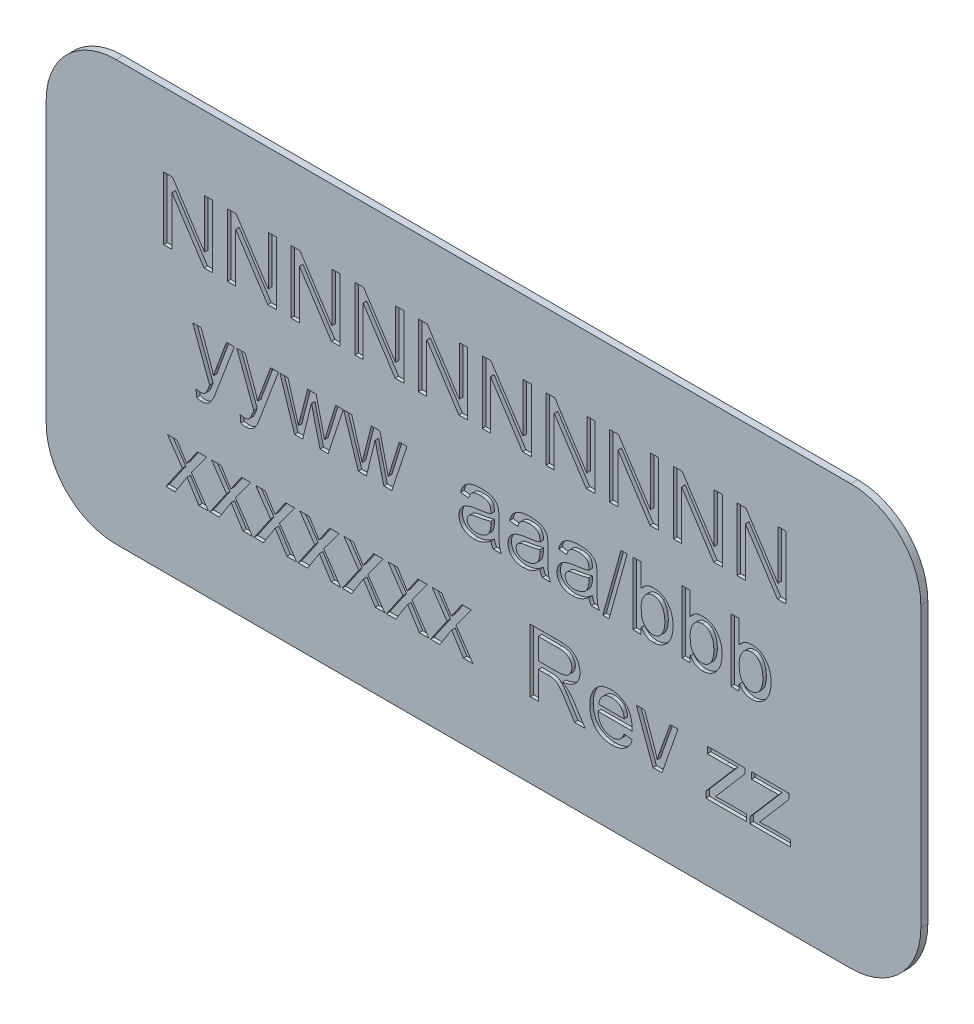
from build123d import *

# Parameters (mm, degrees)
EXTRUSION1_DEPTH = 0.2
EXTRUSION2_DEPTH = 0.1
EXTRUSION3_DEPTH = 0.1
EXTRUSION4_DEPTH = 0.1


with BuildPart() as part:
    # Esquisse1 → Extrusion1 (new body)
    with BuildSketch(Plane.XY):
        with BuildLine():
            Line((2, 0), (23, 0))
            ThreePointArc((23, 0), (24.414213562, 0.585786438), (25, 2))
            Line((25, 2), (25, 10))
            ThreePointArc((25, 10), (24.414213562, 11.414213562), (23, 12))
            Line((23, 12), (2, 12))
            ThreePointArc((2, 12), (0.585786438, 11.414213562), (0, 10))
            Line((0, 10), (0, 2))
            ThreePointArc((0, 2), (0.585786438, 0.585786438), (2, 0))
        make_face()
    extrude(amount=EXTRUSION1_DEPTH)

    # Esquisse2 → Extrusion2 (cut)
    # profile 1 of 12: a face of its own
    with BuildSketch(Plane.XY.offset(0.2)):
        with BuildLine():
            Line((4.634365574, 2.144240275), (4.361481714, 2.144240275))
            Line((4.361481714, 2.144240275), (4.025484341, 2.676144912))
            Line((4.025484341, 2.676144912), (3.688027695, 2.144240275))
            Line((3.688027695, 2.144240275), (3.420251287, 2.144240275))
            Line((3.420251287, 2.144240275), (3.891960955, 2.830098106))
            Line((3.891960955, 2.830098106), (3.46694799, 3.451747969))
            Line((3.46694799, 3.451747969), (3.739831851, 3.451747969))
            add(Edge.make_bspline(
                [(3.739831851, 3.451747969), (3.750057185, 3.435702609), (3.769946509, 3.404492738), (3.798766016, 3.358889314), (3.82571036, 3.315929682), (3.850773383, 3.275653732), (3.874725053, 3.238624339), (3.896073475, 3.203901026), (3.915881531, 3.172031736), (3.93398791, 3.142960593), (3.950642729, 3.116792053), (3.964613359, 3.092895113), (3.977594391, 3.072181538), (3.988396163, 3.053976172), (3.997592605, 3.038697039), (4.00482991, 3.026069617), (4.010897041, 3.016478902), (4.013727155, 3.010582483), (4.014904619, 3.008129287)],
                knots=[0, 0, 0, 0, 1.74943949, 3.402839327, 4.960217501, 6.412111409, 7.764497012, 9.014906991, 10.159833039, 11.214677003, 12.164036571, 13.011607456, 13.759503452, 14.411481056, 14.957995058, 15.399055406, 15.749978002, 16, 16, 16, 16], degree=3))
            Line((4.014904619, 3.008129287), (4.320257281, 3.451747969))
            Line((4.320257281, 3.451747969), (4.587668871, 3.451747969))
            Line((4.587668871, 3.451747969), (4.148792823, 2.854176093))
            Line((4.148792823, 2.854176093), (4.634365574, 2.144240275))
        make_face()
    # profile 2 of 12: a face of its own
    with BuildSketch(Plane.XY.offset(0.2)):
        with BuildLine():
            Line((5.895176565, 2.144240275), (5.622292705, 2.144240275))
            Line((5.622292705, 2.144240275), (5.286295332, 2.676144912))
            Line((5.286295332, 2.676144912), (4.948838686, 2.144240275))
            Line((4.948838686, 2.144240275), (4.681062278, 2.144240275))
            Line((4.681062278, 2.144240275), (5.152771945, 2.830098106))
            Line((5.152771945, 2.830098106), (4.727758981, 3.451747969))
            Line((4.727758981, 3.451747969), (5.000642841, 3.451747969))
            add(Edge.make_bspline(
                [(5.000642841, 3.451747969), (5.010868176, 3.435702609), (5.0307575, 3.404492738), (5.059577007, 3.358889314), (5.086521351, 3.315929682), (5.111584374, 3.275653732), (5.135536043, 3.238624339), (5.156884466, 3.203901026), (5.176692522, 3.172031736), (5.194798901, 3.142960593), (5.211453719, 3.116792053), (5.22542435, 3.092895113), (5.238405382, 3.072181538), (5.249207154, 3.053976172), (5.258403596, 3.038697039), (5.2656409, 3.026069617), (5.271708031, 3.016478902), (5.274538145, 3.010582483), (5.27571561, 3.008129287)],
                knots=[0, 0, 0, 0, 1.74943949, 3.402839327, 4.960217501, 6.412111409, 7.764497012, 9.014906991, 10.159833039, 11.214677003, 12.164036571, 13.011607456, 13.759503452, 14.411481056, 14.957995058, 15.399055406, 15.749978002, 16, 16, 16, 16], degree=3))
            Line((5.27571561, 3.008129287), (5.581068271, 3.451747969))
            Line((5.581068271, 3.451747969), (5.848479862, 3.451747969))
            Line((5.848479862, 3.451747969), (5.409603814, 2.854176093))
            Line((5.409603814, 2.854176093), (5.895176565, 2.144240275))
        make_face()
    # profile 3 of 12: a face of its own
    with BuildSketch(Plane.XY.offset(0.2)):
        with BuildLine():
            Line((7.155987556, 2.144240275), (6.883103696, 2.144240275))
            Line((6.883103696, 2.144240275), (6.547106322, 2.676144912))
            Line((6.547106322, 2.676144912), (6.209649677, 2.144240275))
            Line((6.209649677, 2.144240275), (5.941873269, 2.144240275))
            Line((5.941873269, 2.144240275), (6.413582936, 2.830098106))
            Line((6.413582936, 2.830098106), (5.988569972, 3.451747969))
            Line((5.988569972, 3.451747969), (6.261453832, 3.451747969))
            add(Edge.make_bspline(
                [(6.261453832, 3.451747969), (6.271679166, 3.435702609), (6.29156849, 3.404492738), (6.320387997, 3.358889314), (6.347332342, 3.315929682), (6.372395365, 3.275653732), (6.396347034, 3.238624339), (6.417695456, 3.203901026), (6.437503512, 3.172031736), (6.455609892, 3.142960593), (6.47226471, 3.116792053), (6.486235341, 3.092895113), (6.499216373, 3.072181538), (6.510018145, 3.053976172), (6.519214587, 3.038697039), (6.526451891, 3.026069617), (6.532519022, 3.016478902), (6.535349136, 3.010582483), (6.5365266, 3.008129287)],
                knots=[0, 0, 0, 0, 1.74943949, 3.402839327, 4.960217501, 6.412111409, 7.764497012, 9.014906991, 10.159833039, 11.214677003, 12.164036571, 13.011607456, 13.759503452, 14.411481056, 14.957995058, 15.399055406, 15.749978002, 16, 16, 16, 16], degree=3))
            Line((6.5365266, 3.008129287), (6.841879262, 3.451747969))
            Line((6.841879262, 3.451747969), (7.109290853, 3.451747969))
            Line((7.109290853, 3.451747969), (6.670414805, 2.854176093))
            Line((6.670414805, 2.854176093), (7.155987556, 2.144240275))
        make_face()
    # profile 4 of 12: a face of its own
    with BuildSketch(Plane.XY.offset(0.2)):
        with BuildLine():
            Line((8.416798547, 2.144240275), (8.143914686, 2.144240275))
            Line((8.143914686, 2.144240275), (7.807917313, 2.676144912))
            Line((7.807917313, 2.676144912), (7.470460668, 2.144240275))
            Line((7.470460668, 2.144240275), (7.202684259, 2.144240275))
            Line((7.202684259, 2.144240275), (7.674393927, 2.830098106))
            Line((7.674393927, 2.830098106), (7.249380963, 3.451747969))
            Line((7.249380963, 3.451747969), (7.522264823, 3.451747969))
            add(Edge.make_bspline(
                [(7.522264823, 3.451747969), (7.532490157, 3.435702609), (7.552379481, 3.404492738), (7.581198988, 3.358889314), (7.608143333, 3.315929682), (7.633206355, 3.275653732), (7.657158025, 3.238624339), (7.678506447, 3.203901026), (7.698314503, 3.172031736), (7.716420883, 3.142960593), (7.733075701, 3.116792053), (7.747046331, 3.092895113), (7.760027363, 3.072181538), (7.770829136, 3.053976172), (7.780025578, 3.038697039), (7.787262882, 3.026069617), (7.793330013, 3.016478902), (7.796160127, 3.010582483), (7.797337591, 3.008129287)],
                knots=[0, 0, 0, 0, 1.74943949, 3.402839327, 4.960217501, 6.412111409, 7.764497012, 9.014906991, 10.159833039, 11.214677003, 12.164036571, 13.011607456, 13.759503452, 14.411481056, 14.957995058, 15.399055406, 15.749978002, 16, 16, 16, 16], degree=3))
            Line((7.797337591, 3.008129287), (8.102690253, 3.451747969))
            Line((8.102690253, 3.451747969), (8.370101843, 3.451747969))
            Line((8.370101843, 3.451747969), (7.931225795, 2.854176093))
            Line((7.931225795, 2.854176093), (8.416798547, 2.144240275))
        make_face()
    # profile 5 of 12: a face of its own
    with BuildSketch(Plane.XY.offset(0.2)):
        with BuildLine():
            Line((9.677609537, 2.144240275), (9.404725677, 2.144240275))
            Line((9.404725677, 2.144240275), (9.068728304, 2.676144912))
            Line((9.068728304, 2.676144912), (8.731271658, 2.144240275))
            Line((8.731271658, 2.144240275), (8.46349525, 2.144240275))
            Line((8.46349525, 2.144240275), (8.935204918, 2.830098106))
            Line((8.935204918, 2.830098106), (8.510191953, 3.451747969))
            Line((8.510191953, 3.451747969), (8.783075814, 3.451747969))
            add(Edge.make_bspline(
                [(8.783075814, 3.451747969), (8.793301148, 3.435702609), (8.813190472, 3.404492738), (8.842009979, 3.358889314), (8.868954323, 3.315929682), (8.894017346, 3.275653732), (8.917969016, 3.238624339), (8.939317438, 3.203901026), (8.959125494, 3.172031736), (8.977231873, 3.142960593), (8.993886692, 3.116792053), (9.007857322, 3.092895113), (9.020838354, 3.072181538), (9.031640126, 3.053976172), (9.040836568, 3.038697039), (9.048073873, 3.026069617), (9.054141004, 3.016478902), (9.056971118, 3.010582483), (9.058148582, 3.008129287)],
                knots=[0, 0, 0, 0, 1.74943949, 3.402839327, 4.960217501, 6.412111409, 7.764497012, 9.014906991, 10.159833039, 11.214677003, 12.164036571, 13.011607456, 13.759503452, 14.411481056, 14.957995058, 15.399055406, 15.749978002, 16, 16, 16, 16], degree=3))
            Line((9.058148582, 3.008129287), (9.363501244, 3.451747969))
            Line((9.363501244, 3.451747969), (9.630912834, 3.451747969))
            Line((9.630912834, 3.451747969), (9.192036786, 2.854176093))
            Line((9.192036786, 2.854176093), (9.677609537, 2.144240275))
        make_face()
    # profile 6 of 12: a face of its own
    with BuildSketch(Plane.XY.offset(0.2)):
        with BuildLine():
            Line((10.938420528, 2.144240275), (10.665536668, 2.144240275))
            Line((10.665536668, 2.144240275), (10.329539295, 2.676144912))
            Line((10.329539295, 2.676144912), (9.992082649, 2.144240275))
            Line((9.992082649, 2.144240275), (9.724306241, 2.144240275))
            Line((9.724306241, 2.144240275), (10.196015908, 2.830098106))
            Line((10.196015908, 2.830098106), (9.771002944, 3.451747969))
            Line((9.771002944, 3.451747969), (10.043886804, 3.451747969))
            add(Edge.make_bspline(
                [(10.043886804, 3.451747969), (10.054112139, 3.435702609), (10.074001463, 3.404492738), (10.10282097, 3.358889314), (10.129765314, 3.315929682), (10.154828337, 3.275653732), (10.178780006, 3.238624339), (10.200128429, 3.203901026), (10.219936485, 3.172031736), (10.238042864, 3.142960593), (10.254697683, 3.116792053), (10.268668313, 3.092895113), (10.281649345, 3.072181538), (10.292451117, 3.053976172), (10.301647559, 3.038697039), (10.308884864, 3.026069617), (10.314951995, 3.016478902), (10.317782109, 3.010582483), (10.318959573, 3.008129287)],
                knots=[0, 0, 0, 0, 1.74943949, 3.402839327, 4.960217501, 6.412111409, 7.764497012, 9.014906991, 10.159833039, 11.214677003, 12.164036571, 13.011607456, 13.759503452, 14.411481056, 14.957995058, 15.399055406, 15.749978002, 16, 16, 16, 16], degree=3))
            Line((10.318959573, 3.008129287), (10.624312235, 3.451747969))
            Line((10.624312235, 3.451747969), (10.891723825, 3.451747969))
            Line((10.891723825, 3.451747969), (10.452847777, 2.854176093))
            Line((10.452847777, 2.854176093), (10.938420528, 2.144240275))
        make_face()
    # profile 7 of 12: a face of its own
    with BuildSketch(Plane.XY.offset(0.2)):
        with BuildLine():
            Line((12.199231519, 2.144240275), (11.926347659, 2.144240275))
            Line((11.926347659, 2.144240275), (11.590350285, 2.676144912))
            Line((11.590350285, 2.676144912), (11.25289364, 2.144240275))
            Line((11.25289364, 2.144240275), (10.985117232, 2.144240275))
            Line((10.985117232, 2.144240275), (11.456826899, 2.830098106))
            Line((11.456826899, 2.830098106), (11.031813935, 3.451747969))
            Line((11.031813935, 3.451747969), (11.304697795, 3.451747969))
            add(Edge.make_bspline(
                [(11.304697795, 3.451747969), (11.314923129, 3.435702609), (11.334812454, 3.404492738), (11.36363196, 3.358889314), (11.390576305, 3.315929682), (11.415639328, 3.275653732), (11.439590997, 3.238624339), (11.46093942, 3.203901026), (11.480747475, 3.172031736), (11.498853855, 3.142960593), (11.515508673, 3.116792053), (11.529479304, 3.092895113), (11.542460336, 3.072181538), (11.553262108, 3.053976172), (11.56245855, 3.038697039), (11.569695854, 3.026069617), (11.575762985, 3.016478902), (11.578593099, 3.010582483), (11.579770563, 3.008129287)],
                knots=[0, 0, 0, 0, 1.74943949, 3.402839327, 4.960217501, 6.412111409, 7.764497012, 9.014906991, 10.159833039, 11.214677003, 12.164036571, 13.011607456, 13.759503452, 14.411481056, 14.957995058, 15.399055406, 15.749978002, 16, 16, 16, 16], degree=3))
            Line((11.579770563, 3.008129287), (11.885123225, 3.451747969))
            Line((11.885123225, 3.451747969), (12.152534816, 3.451747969))
            Line((12.152534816, 3.451747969), (11.713658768, 2.854176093))
            Line((11.713658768, 2.854176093), (12.199231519, 2.144240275))
        make_face()
    # profile 8 of 12: a face of its own
    with BuildSketch(Plane.XY.offset(0.2)):
        with BuildLine():
            Line((15.403792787, 2.144240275), (15.101723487, 2.144240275))
            add(Edge.make_bspline(
                [(15.101723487, 2.144240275), (15.09107836, 2.161543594), (15.070321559, 2.195283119), (15.039008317, 2.244068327), (15.009929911, 2.290711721), (14.982644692, 2.335053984), (14.956426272, 2.376399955), (14.931731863, 2.41515623), (14.909346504, 2.45181508), (14.88779749, 2.48545356), (14.86800231, 2.516722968), (14.849725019, 2.5453219), (14.833584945, 2.571799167), (14.817959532, 2.595039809), (14.804504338, 2.616106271), (14.793108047, 2.634928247), (14.782183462, 2.650473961), (14.765802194, 2.676358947), (14.741216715, 2.7110996), (14.708287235, 2.754778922), (14.673782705, 2.794494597), (14.639228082, 2.830822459), (14.604809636, 2.862305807), (14.57096062, 2.888108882), (14.537910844, 2.907299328), (14.504625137, 2.920361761), (14.469400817, 2.928275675), (14.430492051, 2.933923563), (14.386386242, 2.937662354), (14.355314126, 2.937938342), (14.33888906, 2.938084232)],
                knots=[0, 0, 0, 0, 1.472344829, 2.870906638, 4.201239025, 5.45590811, 6.644251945, 7.749451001, 8.786444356, 9.757123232, 10.644658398, 11.468655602, 12.21696757, 12.891641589, 13.497977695, 14.028616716, 14.485727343, 14.874418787, 16.248438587, 17.568748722, 18.837301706, 20.059035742, 21.200877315, 22.214422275, 23.138152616, 23.961395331, 24.795092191, 25.748614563, 26.809892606, 28, 28, 28, 28], degree=3))
            Line((14.33888906, 2.938084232), (14.067099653, 2.938084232))
            Line((14.067099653, 2.938084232), (14.067099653, 2.144240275))
            Line((14.067099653, 2.144240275), (13.833616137, 2.144240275))
            Line((13.833616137, 2.144240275), (13.833616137, 3.942063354))
            Line((13.833616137, 3.942063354), (14.623082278, 3.942063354))
            add(Edge.make_bspline(
                [(14.623082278, 3.942063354), (14.648987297, 3.94173455), (14.69851372, 3.941105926), (14.769627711, 3.937719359), (14.834145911, 3.931117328), (14.892909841, 3.922362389), (14.94703272, 3.909317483), (14.997220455, 3.890335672), (15.044045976, 3.865280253), (15.08697125, 3.834505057), (15.126298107, 3.799121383), (15.160606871, 3.758795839), (15.190178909, 3.714109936), (15.214259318, 3.665437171), (15.23344338, 3.614037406), (15.248050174, 3.561016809), (15.255992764, 3.506224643), (15.257237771, 3.469282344), (15.257865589, 3.450653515)],
                knots=[0, 0, 0, 0, 1.352833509, 2.586410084, 3.716194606, 4.738282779, 5.687017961, 6.617556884, 7.532362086, 8.45215683, 9.369273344, 10.28810307, 11.20923401, 12.1606008, 13.117145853, 14.070650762, 15.027090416, 16, 16, 16, 16], degree=3))
            add(Edge.make_bspline(
                [(15.257865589, 3.450653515), (15.257609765, 3.434089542), (15.257109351, 3.401689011), (15.250416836, 3.354393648), (15.241087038, 3.309369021), (15.226374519, 3.267162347), (15.208796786, 3.227000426), (15.186069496, 3.189799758), (15.160383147, 3.154362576), (15.12968278, 3.122371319), (15.095729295, 3.09267252), (15.057867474, 3.065840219), (15.016092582, 3.042397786), (14.970996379, 3.020950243), (14.921983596, 3.002885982), (14.869310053, 2.98759889), (14.812975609, 2.975211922), (14.774033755, 2.969239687), (14.754051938, 2.966175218)],
                knots=[0, 0, 0, 0, 1.024196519, 2.003414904, 2.951124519, 3.86500246, 4.764387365, 5.658815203, 6.557412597, 7.467782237, 8.395926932, 9.346024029, 10.333622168, 11.357044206, 12.43341384, 13.5622797, 14.749158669, 16, 16, 16, 16], degree=3))
            Line((14.754051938, 2.966175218), (14.754051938, 2.961432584))
            add(Edge.make_bspline(
                [(14.754051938, 2.961432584), (14.769164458, 2.954181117), (14.799954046, 2.939407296), (14.844219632, 2.911244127), (14.88764506, 2.877878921), (14.930343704, 2.839357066), (14.972488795, 2.795896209), (15.013113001, 2.746574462), (15.053919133, 2.692656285), (15.079219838, 2.653812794), (15.092238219, 2.633826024)],
                knots=[0, 0, 0, 0, 0.841908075, 1.715266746, 2.630912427, 3.591790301, 4.603278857, 5.670726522, 6.801481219, 8, 8, 8, 8], degree=3))
            Line((15.092238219, 2.633826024), (15.403792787, 2.144240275))
        make_face()
        with BuildLine():
            Line((14.067099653, 3.148219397), (14.579668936, 3.148219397))
            add(Edge.make_bspline(
                [(14.579668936, 3.148219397), (14.604120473, 3.148564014), (14.650528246, 3.14921808), (14.716099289, 3.15417437), (14.773665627, 3.162418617), (14.824111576, 3.1736369), (14.868428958, 3.190667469), (14.907605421, 3.213867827), (14.942178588, 3.243529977), (14.9710234, 3.279425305), (14.994616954, 3.319256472), (15.012069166, 3.362093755), (15.022631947, 3.407458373), (15.023793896, 3.438558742), (15.024382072, 3.454301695)],
                knots=[0, 0, 0, 0, 1.430580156, 2.715168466, 3.844164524, 4.831320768, 5.732443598, 6.609797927, 7.482639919, 8.382750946, 9.291844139, 10.182370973, 11.079919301, 12, 12, 12, 12], degree=3))
            add(Edge.make_bspline(
                [(15.024382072, 3.454301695), (15.02405606, 3.464524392), (15.023409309, 3.48480438), (15.019657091, 3.514619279), (15.011961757, 3.543085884), (15.002278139, 3.570391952), (14.989687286, 3.596751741), (14.974131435, 3.621706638), (14.955418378, 3.645310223), (14.934555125, 3.668070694), (14.909906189, 3.688534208), (14.88180232, 3.70666709), (14.850014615, 3.721813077), (14.814572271, 3.734350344), (14.775389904, 3.743544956), (14.732736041, 3.750491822), (14.686390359, 3.754420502), (14.654342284, 3.754983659), (14.637674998, 3.755276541)],
                knots=[0, 0, 0, 0, 0.884852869, 1.755388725, 2.592469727, 3.431202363, 4.259508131, 5.114970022, 5.969525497, 6.86284605, 7.78164367, 8.733117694, 9.749625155, 10.82122142, 11.97984086, 13.227046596, 14.557866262, 16, 16, 16, 16], degree=3))
            Line((14.637674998, 3.755276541), (14.067099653, 3.755276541))
            Line((14.067099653, 3.755276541), (14.067099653, 3.148219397))
        make_face(mode=Mode.SUBTRACT)
    # profile 9 of 12: a face of its own
    with BuildSketch(Plane.XY.offset(0.2)):
        with BuildLine():
            Line((16.752160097, 2.751297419), (15.771529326, 2.751297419))
            add(Edge.make_bspline(
                [(15.771529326, 2.751297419), (15.772841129, 2.73387679), (15.77540253, 2.699861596), (15.783646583, 2.650650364), (15.794285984, 2.604421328), (15.808825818, 2.561639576), (15.82529424, 2.521572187), (15.845531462, 2.48498551), (15.8686346, 2.45139116), (15.89483304, 2.421306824), (15.923339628, 2.394553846), (15.953872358, 2.37146629), (15.98602589, 2.351577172), (16.020084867, 2.335558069), (16.055758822, 2.322967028), (16.093225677, 2.314399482), (16.132279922, 2.30866451), (16.158945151, 2.308010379), (16.172464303, 2.307678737)],
                knots=[0, 0, 0, 0, 1.255354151, 2.451180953, 3.583547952, 4.661768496, 5.696101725, 6.693874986, 7.661508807, 8.622126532, 9.55611799, 10.467117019, 11.369771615, 12.269245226, 13.167868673, 14.083971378, 15.028582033, 16, 16, 16, 16], degree=3))
            add(Edge.make_bspline(
                [(16.172464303, 2.307678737), (16.192966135, 2.30836492), (16.232527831, 2.309689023), (16.28918592, 2.322263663), (16.341081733, 2.341620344), (16.38742153, 2.370517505), (16.428776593, 2.407095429), (16.464759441, 2.451902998), (16.495367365, 2.504916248), (16.510687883, 2.54408601), (16.51867658, 2.564510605)],
                knots=[0, 0, 0, 0, 1.058506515, 2.042564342, 2.985975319, 3.909012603, 4.848834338, 5.827797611, 6.867331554, 8, 8, 8, 8], degree=3))
            Line((16.51867658, 2.564510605), (16.752160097, 2.536784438))
            add(Edge.make_bspline(
                [(16.752160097, 2.536784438), (16.747162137, 2.520411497), (16.737382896, 2.488375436), (16.718992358, 2.44231112), (16.697503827, 2.399437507), (16.673287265, 2.359165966), (16.645882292, 2.321964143), (16.615627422, 2.287632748), (16.582387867, 2.256281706), (16.546405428, 2.227908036), (16.507637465, 2.202738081), (16.466617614, 2.180818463), (16.423397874, 2.161965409), (16.377464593, 2.147253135), (16.329507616, 2.135096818), (16.279118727, 2.126709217), (16.226423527, 2.122082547), (16.190470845, 2.12129457), (16.172099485, 2.120891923)],
                knots=[0, 0, 0, 0, 1.061696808, 2.077365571, 3.072656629, 4.033972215, 4.989110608, 5.935148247, 6.869076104, 7.819914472, 8.774098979, 9.732657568, 10.702461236, 11.694917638, 12.721399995, 13.769419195, 14.860201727, 16, 16, 16, 16], degree=3))
            add(Edge.make_bspline(
                [(16.172099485, 2.120891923), (16.147873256, 2.121447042), (16.100607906, 2.122530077), (16.031885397, 2.131095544), (15.967140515, 2.144673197), (15.906706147, 2.16476424), (15.849643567, 2.189154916), (15.797424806, 2.220578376), (15.748993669, 2.257012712), (15.70501938, 2.298953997), (15.665561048, 2.345633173), (15.631368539, 2.396823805), (15.602572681, 2.452176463), (15.578716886, 2.511518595), (15.560596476, 2.575019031), (15.547597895, 2.64239745), (15.539303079, 2.713879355), (15.538472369, 2.762947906), (15.538045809, 2.788144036)],
                knots=[0, 0, 0, 0, 1.114345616, 2.174087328, 3.181535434, 4.152928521, 5.09997417, 6.030765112, 6.94950428, 7.883518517, 8.820577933, 9.756333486, 10.709852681, 11.686516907, 12.69410484, 13.74314279, 14.841130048, 16, 16, 16, 16], degree=3))
            add(Edge.make_bspline(
                [(15.538045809, 2.788144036), (15.538499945, 2.813096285), (15.539388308, 2.861906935), (15.547388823, 2.933211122), (15.559384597, 3.001056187), (15.577494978, 3.065053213), (15.600102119, 3.125682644), (15.6277513, 3.182740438), (15.660864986, 3.235965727), (15.698697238, 3.285259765), (15.741285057, 3.329797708), (15.788281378, 3.36874622), (15.839416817, 3.401902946), (15.89468155, 3.428859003), (15.954123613, 3.450004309), (16.017756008, 3.464028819), (16.085343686, 3.473698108), (16.131811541, 3.474621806), (16.155682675, 3.475096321)],
                knots=[0, 0, 0, 0, 1.14667718, 2.243086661, 3.294610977, 4.310537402, 5.295904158, 6.265976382, 7.220017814, 8.172682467, 9.117639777, 10.04670479, 10.972416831, 11.91246679, 12.867244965, 13.86532686, 14.903391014, 16, 16, 16, 16], degree=3))
            add(Edge.make_bspline(
                [(16.155682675, 3.475096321), (16.179436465, 3.474261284), (16.22684389, 3.472594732), (16.297278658, 3.461077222), (16.366196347, 3.44150073), (16.422165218, 3.41910315), (16.465674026, 3.397139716), (16.497154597, 3.377567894), (16.527595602, 3.355753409), (16.5565209, 3.330718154), (16.584031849, 3.30291305), (16.610957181, 3.273007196), (16.636077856, 3.239993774), (16.659980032, 3.204079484), (16.682207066, 3.164485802), (16.701220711, 3.1200075), (16.716605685, 3.070394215), (16.729734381, 3.016060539), (16.739808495, 2.95681402), (16.746997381, 2.892750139), (16.75139643, 2.823714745), (16.751899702, 2.775990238), (16.752160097, 2.751297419)],
                knots=[0, 0, 0, 0, 1.336073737, 2.666514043, 4.002710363, 5.359395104, 6.050822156, 6.741876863, 7.442481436, 8.15553276, 8.890781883, 9.641805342, 10.417593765, 11.222047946, 12.067210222, 12.96814443, 13.937365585, 14.985971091, 16.110609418, 17.315539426, 18.611051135, 20, 20, 20, 20], degree=3))
        make_face()
        with BuildLine():
            add(Edge.make_bspline(
                [(16.51867658, 2.938084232), (16.517322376, 2.95306744), (16.514699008, 2.982092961), (16.507164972, 3.023926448), (16.495942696, 3.062352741), (16.48292124, 3.098012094), (16.465660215, 3.129875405), (16.446629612, 3.15913262), (16.423543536, 3.184466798), (16.389878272, 3.213616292), (16.343811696, 3.243004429), (16.285548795, 3.269381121), (16.224265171, 3.285424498), (16.182528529, 3.287343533), (16.161519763, 3.288309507)],
                knots=[0, 0, 0, 0, 0.970869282, 1.880771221, 2.737952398, 3.552867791, 4.325358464, 5.072095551, 5.800242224, 6.529065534, 7.94208923, 9.30894394, 10.645416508, 12, 12, 12, 12], degree=3))
            add(Edge.make_bspline(
                [(16.161519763, 3.288309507), (16.1489778, 3.2880749), (16.124407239, 3.287615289), (16.088516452, 3.282670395), (16.054338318, 3.274999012), (16.021717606, 3.264546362), (15.990965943, 3.250552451), (15.961957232, 3.23358044), (15.934371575, 3.213918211), (15.909105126, 3.1908721), (15.885729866, 3.165779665), (15.864854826, 3.138658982), (15.846529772, 3.109718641), (15.830841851, 3.078926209), (15.8175338, 3.046402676), (15.807611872, 3.011829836), (15.799204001, 2.975722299), (15.796336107, 2.950772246), (15.794877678, 2.938084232)],
                knots=[0, 0, 0, 0, 1.073091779, 2.102259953, 3.094814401, 4.069296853, 5.029099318, 5.980793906, 6.942908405, 7.923322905, 8.903073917, 9.875496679, 10.848810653, 11.831212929, 12.830677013, 13.8517574, 14.907540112, 16, 16, 16, 16], degree=3))
            Line((15.794877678, 2.938084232), (16.51867658, 2.938084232))
        make_face(mode=Mode.SUBTRACT)
    # profile 10 of 12: a face of its own
    with BuildSketch(Plane.XY.offset(0.2)):
        with BuildLine():
            Line((18.059667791, 3.451747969), (17.598902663, 2.144240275))
            Line((17.598902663, 2.144240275), (17.343894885, 2.144240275))
            Line((17.343894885, 2.144240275), (16.868901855, 3.451747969))
            Line((16.868901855, 3.451747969), (17.103479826, 3.451747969))
            Line((17.103479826, 3.451747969), (17.373080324, 2.694750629))
            add(Edge.make_bspline(
                [(17.373080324, 2.694750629), (17.379207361, 2.677620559), (17.390916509, 2.644883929), (17.406980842, 2.59765961), (17.421100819, 2.554817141), (17.433629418, 2.516307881), (17.444304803, 2.482193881), (17.452626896, 2.45221761), (17.459349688, 2.426708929), (17.462750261, 2.411054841), (17.464284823, 2.403990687)],
                knots=[0, 0, 0, 0, 1.431951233, 2.73654793, 3.926097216, 4.982501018, 5.924084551, 6.739252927, 7.431068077, 8, 8, 8, 8], degree=3))
            Line((17.464284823, 2.403990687), (17.469027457, 2.403990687))
            add(Edge.make_bspline(
                [(17.469027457, 2.403990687), (17.47269756, 2.418246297), (17.480674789, 2.449231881), (17.495888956, 2.4987997), (17.51449716, 2.555193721), (17.528424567, 2.594935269), (17.53578915, 2.615949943)],
                knots=[0, 0, 0, 0, 0.794510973, 1.726926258, 2.798036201, 4, 4, 4, 4], degree=3))
            Line((17.53578915, 2.615949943), (17.833480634, 3.451747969))
            Line((17.833480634, 3.451747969), (18.059667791, 3.451747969))
        make_face()
    # profile 11 of 12: a face of its own
    with BuildSketch(Plane.XY.offset(0.2)):
        with BuildLine():
            Line((20.020929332, 2.144240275), (18.853511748, 2.144240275))
            Line((18.853511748, 2.144240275), (18.853511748, 2.317893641))
            Line((18.853511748, 2.317893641), (19.676541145, 3.27335197))
            add(Edge.make_bspline(
                [(19.676541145, 3.27335197), (19.653196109, 3.272060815), (19.608463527, 3.269586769), (19.543876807, 3.267210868), (19.484782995, 3.265024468), (19.447072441, 3.264981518), (19.429194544, 3.264961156)],
                knots=[0, 0, 0, 0, 1.133477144, 2.17191182, 3.133336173, 4, 4, 4, 4], degree=3))
            Line((19.429194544, 3.264961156), (18.900208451, 3.264961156))
            Line((18.900208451, 3.264961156), (18.900208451, 3.451747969))
            Line((18.900208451, 3.451747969), (19.974232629, 3.451747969))
            Line((19.974232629, 3.451747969), (19.974232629, 3.303996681))
            Line((19.974232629, 3.303996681), (19.263931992, 2.47440056))
            add(Edge.make_bspline(
                [(19.263931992, 2.47440056), (19.261891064, 2.47182449), (19.257227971, 2.46593871), (19.248539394, 2.456463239), (19.238233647, 2.444535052), (19.225577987, 2.430433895), (19.21083128, 2.414400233), (19.194220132, 2.395761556), (19.175437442, 2.375259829), (19.162150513, 2.360817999), (19.15521623, 2.353280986)],
                knots=[0, 0, 0, 0, 0.484447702, 1.106861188, 1.894567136, 2.808832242, 3.900368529, 5.106500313, 6.48991828, 8, 8, 8, 8], degree=3))
            add(Edge.make_bspline(
                [(19.15521623, 2.353280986), (19.149131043, 2.347408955), (19.138585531, 2.337232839), (19.130275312, 2.325180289), (19.126760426, 2.320082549)],
                knots=[0, 0, 0, 0, 1.154080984, 2, 2, 2, 2], degree=3))
            add(Edge.make_bspline(
                [(19.126760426, 2.320082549), (19.148644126, 2.321738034), (19.193478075, 2.32512969), (19.262433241, 2.328895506), (19.334698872, 2.330499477), (19.383956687, 2.330848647), (19.409129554, 2.331027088)],
                knots=[0, 0, 0, 0, 0.931685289, 1.908778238, 2.931295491, 4, 4, 4, 4], degree=3))
            Line((19.409129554, 2.331027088), (20.020929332, 2.331027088))
            Line((20.020929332, 2.331027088), (20.020929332, 2.144240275))
        make_face()
    # profile 12 of 12: a face of its own
    with BuildSketch(Plane.XY.offset(0.2)):
        with BuildLine():
            Line((21.281740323, 2.144240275), (20.114322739, 2.144240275))
            Line((20.114322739, 2.144240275), (20.114322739, 2.317893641))
            Line((20.114322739, 2.317893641), (20.937352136, 3.27335197))
            add(Edge.make_bspline(
                [(20.937352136, 3.27335197), (20.9140071, 3.272060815), (20.869274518, 3.269586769), (20.804687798, 3.267210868), (20.745593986, 3.265024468), (20.707883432, 3.264981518), (20.690005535, 3.264961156)],
                knots=[0, 0, 0, 0, 1.133477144, 2.17191182, 3.133336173, 4, 4, 4, 4], degree=3))
            Line((20.690005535, 3.264961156), (20.161019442, 3.264961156))
            Line((20.161019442, 3.264961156), (20.161019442, 3.451747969))
            Line((20.161019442, 3.451747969), (21.23504362, 3.451747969))
            Line((21.23504362, 3.451747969), (21.23504362, 3.303996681))
            Line((21.23504362, 3.303996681), (20.524742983, 2.47440056))
            add(Edge.make_bspline(
                [(20.524742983, 2.47440056), (20.522702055, 2.47182449), (20.518038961, 2.46593871), (20.509350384, 2.456463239), (20.499044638, 2.444535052), (20.486388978, 2.430433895), (20.47164227, 2.414400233), (20.455031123, 2.395761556), (20.436248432, 2.375259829), (20.422961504, 2.360817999), (20.416027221, 2.353280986)],
                knots=[0, 0, 0, 0, 0.484447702, 1.106861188, 1.894567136, 2.808832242, 3.900368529, 5.106500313, 6.48991828, 8, 8, 8, 8], degree=3))
            add(Edge.make_bspline(
                [(20.416027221, 2.353280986), (20.409942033, 2.347408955), (20.399396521, 2.337232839), (20.391086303, 2.325180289), (20.387571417, 2.320082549)],
                knots=[0, 0, 0, 0, 1.154080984, 2, 2, 2, 2], degree=3))
            add(Edge.make_bspline(
                [(20.387571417, 2.320082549), (20.409455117, 2.321738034), (20.454289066, 2.32512969), (20.523244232, 2.328895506), (20.595509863, 2.330499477), (20.644767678, 2.330848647), (20.669940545, 2.331027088)],
                knots=[0, 0, 0, 0, 0.931685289, 1.908778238, 2.931295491, 4, 4, 4, 4], degree=3))
            Line((20.669940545, 2.331027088), (21.281740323, 2.331027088))
            Line((21.281740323, 2.331027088), (21.281740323, 2.144240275))
        make_face()
    extrude(amount=-EXTRUSION2_DEPTH, mode=Mode.SUBTRACT)

    # Esquisse3 → Extrusion3 (cut)
    with BuildSketch(Plane.XY.offset(0.2)):
        Polygon((4.759805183, 8.099456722), (4.50917522, 8.099456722), (3.597130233, 9.500722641), (3.592387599, 9.500722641), (3.592387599, 8.099456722), (3.358904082, 8.099456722), (3.358904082, 9.897279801), (3.609534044, 9.897279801), (4.521579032, 8.495649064), (4.526321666, 8.495649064), (4.526321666, 9.897279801), (4.759805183, 9.897279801), align=None)
        Polygon((6.580976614, 8.099456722), (6.330346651, 8.099456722), (5.418301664, 9.500722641), (5.41355903, 9.500722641), (5.41355903, 8.099456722), (5.180075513, 8.099456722), (5.180075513, 9.897279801), (5.430705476, 9.897279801), (6.342750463, 8.495649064), (6.347493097, 8.495649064), (6.347493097, 9.897279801), (6.580976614, 9.897279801), align=None)
        Polygon((8.402148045, 8.099456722), (8.151518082, 8.099456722), (7.239473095, 9.500722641), (7.234730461, 9.500722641), (7.234730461, 8.099456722), (7.001246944, 8.099456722), (7.001246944, 9.897279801), (7.251876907, 9.897279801), (8.163921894, 8.495649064), (8.168664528, 8.495649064), (8.168664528, 9.897279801), (8.402148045, 9.897279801), align=None)
        Polygon((10.223319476, 8.099456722), (9.972689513, 8.099456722), (9.060644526, 9.500722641), (9.055901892, 9.500722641), (9.055901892, 8.099456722), (8.822418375, 8.099456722), (8.822418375, 9.897279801), (9.073048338, 9.897279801), (9.985093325, 8.495649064), (9.989835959, 8.495649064), (9.989835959, 9.897279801), (10.223319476, 9.897279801), align=None)
        Polygon((12.044490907, 8.099456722), (11.793860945, 8.099456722), (10.881815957, 9.500722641), (10.877073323, 9.500722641), (10.877073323, 8.099456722), (10.643589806, 8.099456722), (10.643589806, 9.897279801), (10.894219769, 9.897279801), (11.806264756, 8.495649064), (11.81100739, 8.495649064), (11.81100739, 9.897279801), (12.044490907, 9.897279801), align=None)
        Polygon((13.865662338, 8.099456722), (13.615032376, 8.099456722), (12.702987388, 9.500722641), (12.698244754, 9.500722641), (12.698244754, 8.099456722), (12.464761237, 8.099456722), (12.464761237, 9.897279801), (12.7153912, 9.897279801), (13.627436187, 8.495649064), (13.632178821, 8.495649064), (13.632178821, 9.897279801), (13.865662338, 9.897279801), align=None)
        Polygon((15.686833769, 8.099456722), (15.436203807, 8.099456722), (14.524158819, 9.500722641), (14.519416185, 9.500722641), (14.519416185, 8.099456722), (14.285932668, 8.099456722), (14.285932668, 9.897279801), (14.536562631, 9.897279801), (15.448607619, 8.495649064), (15.453350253, 8.495649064), (15.453350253, 9.897279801), (15.686833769, 9.897279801), align=None)
        Polygon((17.5080052, 8.099456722), (17.257375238, 8.099456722), (16.34533025, 9.500722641), (16.340587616, 9.500722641), (16.340587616, 8.099456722), (16.1071041, 8.099456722), (16.1071041, 9.897279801), (16.357734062, 9.897279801), (17.26977905, 8.495649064), (17.274521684, 8.495649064), (17.274521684, 9.897279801), (17.5080052, 9.897279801), align=None)
        Polygon((19.329176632, 8.099456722), (19.078546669, 8.099456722), (18.166501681, 9.500722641), (18.161759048, 9.500722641), (18.161759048, 8.099456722), (17.928275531, 8.099456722), (17.928275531, 9.897279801), (18.178905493, 9.897279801), (19.090950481, 8.495649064), (19.095693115, 8.495649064), (19.095693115, 9.897279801), (19.329176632, 9.897279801), align=None)
        Polygon((21.150348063, 8.099456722), (20.8997181, 8.099456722), (19.987673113, 9.500722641), (19.982930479, 9.500722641), (19.982930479, 8.099456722), (19.749446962, 8.099456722), (19.749446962, 9.897279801), (20.000076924, 9.897279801), (20.912121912, 8.495649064), (20.916864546, 8.495649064), (20.916864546, 9.897279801), (21.150348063, 9.897279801), align=None)
    extrude(amount=-EXTRUSION3_DEPTH, mode=Mode.SUBTRACT)

    # Esquisse4 → Extrusion4 (cut)
    # profile 1 of 11: a face of its own
    with BuildSketch(Plane.XY.offset(0.2)):
        with BuildLine():
            Line((5.37876763, 6.578236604), (4.878966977, 5.257230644))
            add(Edge.make_bspline(
                [(4.878966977, 5.257230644), (4.878575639, 5.256143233), (4.877553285, 5.253302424), (4.877073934, 5.250317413), (4.876778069, 5.248475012)],
                knots=[0, 0, 0, 0, 0.765564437, 2, 2, 2, 2], degree=3))
            add(Edge.make_bspline(
                [(4.876778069, 5.248475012), (4.870798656, 5.230564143), (4.859068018, 5.195425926), (4.840095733, 5.144320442), (4.820274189, 5.095883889), (4.800552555, 5.049738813), (4.77907575, 5.006804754), (4.757820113, 4.965990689), (4.734949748, 4.928296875), (4.71243272, 4.892564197), (4.687701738, 4.860622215), (4.660419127, 4.832921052), (4.630767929, 4.809295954), (4.598261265, 4.790252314), (4.563396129, 4.77510792), (4.525960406, 4.764627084), (4.486149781, 4.758325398), (4.458841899, 4.757492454), (4.444833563, 4.757065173)],
                knots=[0, 0, 0, 0, 1.284023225, 2.519045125, 3.706096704, 4.843005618, 5.930321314, 6.969856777, 7.971124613, 8.927611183, 9.840753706, 10.712046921, 11.56573804, 12.411016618, 13.266668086, 14.143594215, 15.047705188, 16, 16, 16, 16], degree=3))
            add(Edge.make_bspline(
                [(4.444833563, 4.757065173), (4.434601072, 4.757343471), (4.413063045, 4.757929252), (4.379224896, 4.763253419), (4.342168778, 4.770744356), (4.316621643, 4.777816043), (4.303284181, 4.781507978)],
                knots=[0, 0, 0, 0, 0.851797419, 1.792919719, 2.847743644, 4, 4, 4, 4], degree=3))
            Line((4.303284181, 4.781507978), (4.281395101, 4.990548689))
            add(Edge.make_bspline(
                [(4.281395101, 4.990548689), (4.29143072, 4.986955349), (4.311136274, 4.979899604), (4.341207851, 4.972700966), (4.370873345, 4.968060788), (4.390580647, 4.967485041), (4.400325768, 4.967200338)],
                knots=[0, 0, 0, 0, 1.049101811, 2.059975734, 3.04067179, 4, 4, 4, 4], degree=3))
            add(Edge.make_bspline(
                [(4.400325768, 4.967200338), (4.4097017, 4.967383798), (4.427785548, 4.967737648), (4.453761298, 4.971179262), (4.477654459, 4.976100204), (4.499279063, 4.983318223), (4.518576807, 4.992887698), (4.535426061, 5.004686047), (4.550359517, 5.018272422), (4.562994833, 5.034662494), (4.574649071, 5.05370809), (4.586728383, 5.07579408), (4.59936714, 5.101291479), (4.612829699, 5.130136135), (4.62710177, 5.162178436), (4.641647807, 5.197767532), (4.65691759, 5.236705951), (4.66716227, 5.263906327), (4.672479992, 5.278025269)],
                knots=[0, 0, 0, 0, 0.998111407, 1.925109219, 2.786339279, 3.593259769, 4.346298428, 5.072109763, 5.777881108, 6.487918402, 7.267771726, 8.154721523, 9.168427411, 10.298356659, 11.545113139, 12.904155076, 14.393034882, 16, 16, 16, 16], degree=3))
            Line((4.672479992, 5.278025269), (4.188001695, 6.578236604))
            Line((4.188001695, 6.578236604), (4.425863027, 6.578236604))
            Line((4.425863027, 6.578236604), (4.723189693, 5.761044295))
            add(Edge.make_bspline(
                [(4.723189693, 5.761044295), (4.727812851, 5.747706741), (4.737667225, 5.71927742), (4.750633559, 5.673300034), (4.765192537, 5.622103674), (4.774247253, 5.585959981), (4.779006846, 5.566961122)],
                knots=[0, 0, 0, 0, 0.838322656, 1.786905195, 2.836691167, 4, 4, 4, 4], degree=3))
            Line((4.779006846, 5.566961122), (4.78374948, 5.566961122))
            add(Edge.make_bspline(
                [(4.78374948, 5.566961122), (4.794779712, 5.605898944), (4.816579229, 5.68285342), (4.847349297, 5.756677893), (4.862550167, 5.793148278)],
                knots=[0, 0, 0, 0, 1.01197033, 2, 2, 2, 2], degree=3))
            Line((4.862550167, 5.793148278), (5.152945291, 6.578236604))
            Line((5.152945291, 6.578236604), (5.37876763, 6.578236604))
        make_face()
    # profile 2 of 11: a face of its own
    with BuildSketch(Plane.XY.offset(0.2)):
        with BuildLine():
            Line((6.639578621, 6.578236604), (6.139777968, 5.257230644))
            add(Edge.make_bspline(
                [(6.139777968, 5.257230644), (6.139386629, 5.256143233), (6.138364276, 5.253302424), (6.137884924, 5.250317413), (6.13758906, 5.248475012)],
                knots=[0, 0, 0, 0, 0.765564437, 2, 2, 2, 2], degree=3))
            add(Edge.make_bspline(
                [(6.13758906, 5.248475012), (6.131609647, 5.230564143), (6.119879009, 5.195425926), (6.100906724, 5.144320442), (6.08108518, 5.095883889), (6.061363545, 5.049738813), (6.039886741, 5.006804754), (6.018631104, 4.965990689), (5.995760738, 4.928296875), (5.973243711, 4.892564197), (5.948512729, 4.860622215), (5.921230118, 4.832921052), (5.89157892, 4.809295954), (5.859072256, 4.790252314), (5.82420712, 4.77510792), (5.786771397, 4.764627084), (5.746960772, 4.758325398), (5.719652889, 4.757492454), (5.705644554, 4.757065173)],
                knots=[0, 0, 0, 0, 1.284023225, 2.519045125, 3.706096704, 4.843005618, 5.930321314, 6.969856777, 7.971124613, 8.927611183, 9.840753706, 10.712046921, 11.56573804, 12.411016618, 13.266668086, 14.143594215, 15.047705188, 16, 16, 16, 16], degree=3))
            add(Edge.make_bspline(
                [(5.705644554, 4.757065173), (5.695412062, 4.757343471), (5.673874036, 4.757929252), (5.640035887, 4.763253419), (5.602979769, 4.770744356), (5.577432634, 4.777816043), (5.564095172, 4.781507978)],
                knots=[0, 0, 0, 0, 0.851797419, 1.792919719, 2.847743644, 4, 4, 4, 4], degree=3))
            Line((5.564095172, 4.781507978), (5.542206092, 4.990548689))
            add(Edge.make_bspline(
                [(5.542206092, 4.990548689), (5.552241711, 4.986955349), (5.571947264, 4.979899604), (5.602018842, 4.972700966), (5.631684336, 4.968060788), (5.651391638, 4.967485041), (5.661136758, 4.967200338)],
                knots=[0, 0, 0, 0, 1.049101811, 2.059975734, 3.04067179, 4, 4, 4, 4], degree=3))
            add(Edge.make_bspline(
                [(5.661136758, 4.967200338), (5.670512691, 4.967383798), (5.688596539, 4.967737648), (5.714572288, 4.971179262), (5.73846545, 4.976100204), (5.760090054, 4.983318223), (5.779387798, 4.992887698), (5.796237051, 5.004686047), (5.811170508, 5.018272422), (5.823805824, 5.034662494), (5.835460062, 5.05370809), (5.847539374, 5.07579408), (5.86017813, 5.101291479), (5.873640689, 5.130136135), (5.887912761, 5.162178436), (5.902458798, 5.197767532), (5.91772858, 5.236705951), (5.92797326, 5.263906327), (5.933290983, 5.278025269)],
                knots=[0, 0, 0, 0, 0.998111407, 1.925109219, 2.786339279, 3.593259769, 4.346298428, 5.072109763, 5.777881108, 6.487918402, 7.267771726, 8.154721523, 9.168427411, 10.298356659, 11.545113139, 12.904155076, 14.393034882, 16, 16, 16, 16], degree=3))
            Line((5.933290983, 5.278025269), (5.448812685, 6.578236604))
            Line((5.448812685, 6.578236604), (5.686674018, 6.578236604))
            Line((5.686674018, 6.578236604), (5.984000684, 5.761044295))
            add(Edge.make_bspline(
                [(5.984000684, 5.761044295), (5.988623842, 5.747706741), (5.998478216, 5.71927742), (6.01144455, 5.673300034), (6.026003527, 5.622103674), (6.035058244, 5.585959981), (6.039817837, 5.566961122)],
                knots=[0, 0, 0, 0, 0.838322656, 1.786905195, 2.836691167, 4, 4, 4, 4], degree=3))
            Line((6.039817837, 5.566961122), (6.044560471, 5.566961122))
            add(Edge.make_bspline(
                [(6.044560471, 5.566961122), (6.055590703, 5.605898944), (6.07739022, 5.68285342), (6.108160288, 5.756677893), (6.123361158, 5.793148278)],
                knots=[0, 0, 0, 0, 1.01197033, 2, 2, 2, 2], degree=3))
            Line((6.123361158, 5.793148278), (6.413756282, 6.578236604))
            Line((6.413756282, 6.578236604), (6.639578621, 6.578236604))
        make_face()
    # profile 3 of 11: a face of its own
    with BuildSketch(Plane.XY.offset(0.2)):
        with BuildLine():
            Line((8.489935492, 6.578236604), (8.057990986, 5.27072891))
            Line((8.057990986, 5.27072891), (7.828520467, 5.27072891))
            Line((7.828520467, 5.27072891), (7.632978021, 6.055817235))
            add(Edge.make_bspline(
                [(7.632978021, 6.055817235), (7.632719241, 6.056420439), (7.631819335, 6.05851807), (7.631058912, 6.063675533), (7.628474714, 6.071776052), (7.626403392, 6.083507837), (7.622269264, 6.098169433), (7.618590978, 6.116397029), (7.61374494, 6.13789652), (7.608494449, 6.161727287), (7.60330708, 6.185692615), (7.598509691, 6.207691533), (7.594495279, 6.226662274), (7.591194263, 6.242710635), (7.588661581, 6.255728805), (7.586815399, 6.265693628), (7.585582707, 6.27261461), (7.585292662, 6.276287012), (7.585186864, 6.277626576)],
                knots=[0, 0, 0, 0, 0.13847848, 0.481556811, 1.092790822, 1.935122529, 2.995371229, 4.311858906, 5.865424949, 7.656069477, 9.471833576, 11.050521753, 12.417282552, 13.572160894, 14.515231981, 15.221336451, 15.715970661, 16, 16, 16, 16], degree=3))
            Line((7.585186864, 6.277626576), (7.58044423, 6.277626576))
            Line((7.58044423, 6.277626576), (7.331638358, 5.27072891))
            Line((7.331638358, 5.27072891), (7.101073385, 5.27072891))
            Line((7.101073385, 5.27072891), (6.680438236, 6.578236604))
            Line((6.680438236, 6.578236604), (6.911732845, 6.578236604))
            Line((6.911732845, 6.578236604), (7.211613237, 5.542883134))
            Line((7.211613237, 5.542883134), (7.253202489, 5.719090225))
            Line((7.253202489, 5.719090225), (7.472093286, 6.578236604))
            Line((7.472093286, 6.578236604), (7.715791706, 6.578236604))
            Line((7.715791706, 6.578236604), (7.87886535, 5.893108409))
            add(Edge.make_bspline(
                [(7.87886535, 5.893108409), (7.884203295, 5.870729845), (7.894242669, 5.828641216), (7.908592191, 5.769326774), (7.920910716, 5.717623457), (7.931566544, 5.673528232), (7.940057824, 5.637186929), (7.946044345, 5.608387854), (7.951090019, 5.587464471), (7.953199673, 5.575845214), (7.954017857, 5.571338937)],
                knots=[0, 0, 0, 0, 1.670912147, 3.142578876, 4.432176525, 5.531116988, 6.437379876, 7.142450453, 7.667417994, 8, 8, 8, 8], degree=3))
            Line((7.954017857, 5.571338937), (7.958760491, 5.571338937))
            Line((7.958760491, 5.571338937), (8.272503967, 6.578236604))
            Line((8.272503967, 6.578236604), (8.489935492, 6.578236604))
        make_face()
    # profile 4 of 11: a face of its own
    with BuildSketch(Plane.XY.offset(0.2)):
        with BuildLine():
            Line((10.311106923, 6.578236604), (9.879162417, 5.27072891))
            Line((9.879162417, 5.27072891), (9.649691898, 5.27072891))
            Line((9.649691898, 5.27072891), (9.454149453, 6.055817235))
            add(Edge.make_bspline(
                [(9.454149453, 6.055817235), (9.453890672, 6.056420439), (9.452990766, 6.05851807), (9.452230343, 6.063675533), (9.449646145, 6.071776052), (9.447574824, 6.083507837), (9.443440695, 6.098169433), (9.439762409, 6.116397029), (9.434916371, 6.13789652), (9.42966588, 6.161727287), (9.424478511, 6.185692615), (9.419681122, 6.207691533), (9.41566671, 6.226662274), (9.412365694, 6.242710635), (9.409833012, 6.255728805), (9.40798683, 6.265693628), (9.406754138, 6.27261461), (9.406464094, 6.276287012), (9.406358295, 6.277626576)],
                knots=[0, 0, 0, 0, 0.13847848, 0.481556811, 1.092790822, 1.935122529, 2.995371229, 4.311858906, 5.865424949, 7.656069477, 9.471833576, 11.050521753, 12.417282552, 13.572160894, 14.515231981, 15.221336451, 15.715970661, 16, 16, 16, 16], degree=3))
            Line((9.406358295, 6.277626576), (9.401615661, 6.277626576))
            Line((9.401615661, 6.277626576), (9.152809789, 5.27072891))
            Line((9.152809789, 5.27072891), (8.922244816, 5.27072891))
            Line((8.922244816, 5.27072891), (8.501609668, 6.578236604))
            Line((8.501609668, 6.578236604), (8.732904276, 6.578236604))
            Line((8.732904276, 6.578236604), (9.032784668, 5.542883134))
            Line((9.032784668, 5.542883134), (9.07437392, 5.719090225))
            Line((9.07437392, 5.719090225), (9.293264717, 6.578236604))
            Line((9.293264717, 6.578236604), (9.536963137, 6.578236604))
            Line((9.536963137, 6.578236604), (9.700036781, 5.893108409))
            add(Edge.make_bspline(
                [(9.700036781, 5.893108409), (9.705374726, 5.870729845), (9.7154141, 5.828641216), (9.729763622, 5.769326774), (9.742082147, 5.717623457), (9.752737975, 5.673528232), (9.761229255, 5.637186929), (9.767215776, 5.608387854), (9.77226145, 5.587464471), (9.774371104, 5.575845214), (9.775189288, 5.571338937)],
                knots=[0, 0, 0, 0, 1.670912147, 3.142578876, 4.432176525, 5.531116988, 6.437379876, 7.142450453, 7.667417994, 8, 8, 8, 8], degree=3))
            Line((9.775189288, 5.571338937), (9.779931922, 5.571338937))
            Line((9.779931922, 5.571338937), (10.093675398, 6.578236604))
            Line((10.093675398, 6.578236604), (10.311106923, 6.578236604))
        make_face()
    # profile 5 of 11: a face of its own
    with BuildSketch(Plane.XY.offset(0.2)):
        with BuildLine():
            Line((13.01367863, 5.27072891), (12.780195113, 5.27072891))
            add(Edge.make_bspline(
                [(12.780195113, 5.27072891), (12.772155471, 5.282060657), (12.755598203, 5.305397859), (12.737369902, 5.3459896), (12.720691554, 5.390518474), (12.713751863, 5.422615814), (12.710150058, 5.439274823)],
                knots=[0, 0, 0, 0, 0.903978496, 1.861701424, 2.890190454, 4, 4, 4, 4], degree=3))
            add(Edge.make_bspline(
                [(12.710150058, 5.439274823), (12.69203914, 5.423990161), (12.656413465, 5.393923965), (12.599608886, 5.355212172), (12.542328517, 5.321301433), (12.483200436, 5.295033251), (12.423508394, 5.273261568), (12.362416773, 5.258629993), (12.300285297, 5.248906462), (12.258420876, 5.2478915), (12.237345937, 5.247380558)],
                knots=[0, 0, 0, 0, 1.089286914, 2.142717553, 3.15767242, 4.14639824, 5.114065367, 6.075847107, 7.031363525, 8, 8, 8, 8], degree=3))
            add(Edge.make_bspline(
                [(12.237345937, 5.247380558), (12.220790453, 5.247570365), (12.18856719, 5.247939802), (12.141663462, 5.253417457), (12.097433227, 5.261138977), (12.055922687, 5.272536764), (12.01702407, 5.287083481), (11.980854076, 5.305131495), (11.94689028, 5.325774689), (11.916451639, 5.350363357), (11.88892984, 5.377269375), (11.865271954, 5.406731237), (11.84434324, 5.43779288), (11.828140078, 5.471589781), (11.815250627, 5.507150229), (11.806104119, 5.544815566), (11.800573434, 5.584550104), (11.799904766, 5.611815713), (11.799564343, 5.625696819)],
                knots=[0, 0, 0, 0, 1.216620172, 2.368005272, 3.467709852, 4.515474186, 5.528552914, 6.516295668, 7.48404396, 8.444826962, 9.386953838, 10.308660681, 11.218844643, 12.134633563, 13.056730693, 13.995797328, 14.979646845, 16, 16, 16, 16], degree=3))
            add(Edge.make_bspline(
                [(11.799564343, 5.625696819), (11.799896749, 5.638973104), (11.800552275, 5.665154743), (11.806256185, 5.703365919), (11.814841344, 5.74003369), (11.827722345, 5.774577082), (11.843966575, 5.807464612), (11.863581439, 5.838573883), (11.887390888, 5.867527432), (11.914355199, 5.895227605), (11.946295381, 5.920538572), (11.982921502, 5.944074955), (12.025292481, 5.964684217), (12.072801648, 5.983163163), (12.125492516, 5.999485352), (12.183369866, 6.013632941), (12.246453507, 6.025653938), (12.29045482, 6.031587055), (12.31322808, 6.034657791)],
                knots=[0, 0, 0, 0, 0.872498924, 1.720620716, 2.535170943, 3.344721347, 4.138600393, 4.943834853, 5.75681365, 6.59930027, 7.480948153, 8.430305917, 9.456622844, 10.573255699, 11.779617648, 13.080931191, 14.489210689, 16, 16, 16, 16], degree=3))
            Line((12.31322808, 6.034657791), (12.519715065, 6.065667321))
            add(Edge.make_bspline(
                [(12.519715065, 6.065667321), (12.538221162, 6.068832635), (12.57351392, 6.074869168), (12.62384401, 6.085385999), (12.66897899, 6.097117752), (12.696944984, 6.106730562), (12.710150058, 6.11126957)],
                knots=[0, 0, 0, 0, 1.148822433, 2.19090552, 3.145775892, 4, 4, 4, 4], degree=3))
            add(Edge.make_bspline(
                [(12.710150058, 6.11126957), (12.710087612, 6.125619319), (12.709972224, 6.152134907), (12.708985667, 6.18839439), (12.707182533, 6.217836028), (12.704916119, 6.24170335), (12.700216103, 6.262552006), (12.692911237, 6.282552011), (12.682431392, 6.302761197), (12.669419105, 6.32312999), (12.653028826, 6.343317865), (12.631536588, 6.360971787), (12.605961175, 6.376920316), (12.575686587, 6.390208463), (12.540853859, 6.401717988), (12.500547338, 6.409486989), (12.454890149, 6.414160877), (12.422564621, 6.414578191), (12.405527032, 6.414798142)],
                knots=[0, 0, 0, 0, 1.352390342, 2.498958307, 3.417589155, 4.132656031, 4.755438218, 5.426148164, 6.133458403, 6.896422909, 7.702008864, 8.57217888, 9.503941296, 10.534942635, 11.680192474, 12.954580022, 14.394871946, 16, 16, 16, 16], degree=3))
            add(Edge.make_bspline(
                [(12.405527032, 6.414798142), (12.383835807, 6.414385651), (12.342651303, 6.413602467), (12.284490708, 6.403821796), (12.233048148, 6.389070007), (12.1955697, 6.370339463), (12.169293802, 6.351997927), (12.151816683, 6.335363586), (12.135720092, 6.316253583), (12.120941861, 6.29461055), (12.108354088, 6.269966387), (12.097081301, 6.242873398), (12.087033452, 6.213190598), (12.082231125, 6.19218893), (12.079744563, 6.181314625)],
                knots=[0, 0, 0, 0, 1.754488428, 3.33119665, 4.761009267, 6.073287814, 6.701707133, 7.349574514, 8.020310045, 8.722196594, 9.466521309, 10.256534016, 11.097263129, 12, 12, 12, 12], degree=3))
            Line((12.079744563, 6.181314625), (11.846261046, 6.209040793))
            add(Edge.make_bspline(
                [(11.846261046, 6.209040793), (11.849475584, 6.224927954), (11.855758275, 6.255978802), (11.870315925, 6.300503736), (11.888049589, 6.34207377), (11.90929646, 6.380588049), (11.933887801, 6.416128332), (11.96255908, 6.448180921), (11.994455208, 6.477497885), (12.029631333, 6.504009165), (12.068656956, 6.526981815), (12.111084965, 6.546960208), (12.156899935, 6.56423977), (12.20624421, 6.57796997), (12.259072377, 6.588467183), (12.315245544, 6.595973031), (12.37491574, 6.600914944), (12.415853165, 6.601357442), (12.43690138, 6.601584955)],
                knots=[0, 0, 0, 0, 0.995121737, 1.944927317, 2.871981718, 3.768176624, 4.642811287, 5.521362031, 6.404380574, 7.300917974, 8.222174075, 9.181307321, 10.17903391, 11.226833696, 12.324278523, 13.485482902, 14.707146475, 16, 16, 16, 16], degree=3))
            add(Edge.make_bspline(
                [(12.43690138, 6.601584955), (12.455876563, 6.601388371), (12.49251961, 6.601008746), (12.545606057, 6.597727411), (12.5946514, 6.592253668), (12.639939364, 6.585218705), (12.6812561, 6.575331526), (12.718705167, 6.563412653), (12.752493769, 6.549656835), (12.782087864, 6.533052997), (12.80835619, 6.514924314), (12.832358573, 6.496540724), (12.853076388, 6.476485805), (12.8719251, 6.456439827), (12.887299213, 6.434748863), (12.900682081, 6.41262242), (12.910836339, 6.389112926), (12.921177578, 6.355815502), (12.930424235, 6.310198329), (12.9382949, 6.25034607), (12.94297634, 6.183455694), (12.943407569, 6.136571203), (12.943633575, 6.111999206)],
                knots=[0, 0, 0, 0, 1.367973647, 2.641699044, 3.83258734, 4.925145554, 5.943754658, 6.892017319, 7.756622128, 8.569019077, 9.332592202, 10.056954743, 10.745352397, 11.409424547, 12.037261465, 12.658266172, 13.270733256, 13.877969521, 15.169404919, 16.620144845, 18.228629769, 20, 20, 20, 20], degree=3))
            Line((12.943633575, 6.111999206), (12.943633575, 5.815402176))
            add(Edge.make_bspline(
                [(12.943633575, 5.815402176), (12.943558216, 5.793755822), (12.943413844, 5.752285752), (12.944394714, 5.692945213), (12.944956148, 5.639068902), (12.946071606, 5.5907899), (12.94740982, 5.548096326), (12.949428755, 5.511021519), (12.950903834, 5.479478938), (12.954329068, 5.444830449), (12.960758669, 5.405326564), (12.973202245, 5.359559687), (12.990828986, 5.314366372), (13.005979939, 5.285431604), (13.01367863, 5.27072891)],
                knots=[0, 0, 0, 0, 1.402077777, 2.686099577, 3.844102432, 4.89198882, 5.814117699, 6.610652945, 7.297068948, 7.859036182, 8.865208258, 9.885586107, 10.925597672, 12, 12, 12, 12], degree=3))
        make_face()
        with BuildLine():
            Line((12.710150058, 5.84750616), (12.710150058, 5.924482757))
            add(Edge.make_bspline(
                [(12.710150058, 5.924482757), (12.679597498, 5.915376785), (12.615789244, 5.896359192), (12.513920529, 5.873744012), (12.402693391, 5.85235578), (12.305082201, 5.839947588), (12.227561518, 5.827928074), (12.176055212, 5.813399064), (12.132067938, 5.794711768), (12.095784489, 5.771303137), (12.067529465, 5.742969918), (12.047336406, 5.710170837), (12.035152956, 5.672733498), (12.033767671, 5.646341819), (12.033047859, 5.632628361)],
                knots=[0, 0, 0, 0, 1.446121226, 3.020187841, 4.732247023, 6.583196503, 7.48489336, 8.288294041, 9.004862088, 9.646088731, 10.235252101, 10.804947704, 11.379035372, 12, 12, 12, 12], degree=3))
            add(Edge.make_bspline(
                [(12.033047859, 5.632628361), (12.033845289, 5.618773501), (12.035399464, 5.591770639), (12.048997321, 5.553335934), (12.070559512, 5.518765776), (12.10065226, 5.488562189), (12.13882402, 5.463818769), (12.184875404, 5.446663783), (12.237955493, 5.435979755), (12.275716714, 5.434794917), (12.295716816, 5.434167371)],
                knots=[0, 0, 0, 0, 0.897954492, 1.750096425, 2.616193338, 3.526990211, 4.497948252, 5.548655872, 6.701653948, 8, 8, 8, 8], degree=3))
            add(Edge.make_bspline(
                [(12.295716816, 5.434167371), (12.3092276, 5.434436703), (12.335835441, 5.43496712), (12.375109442, 5.439503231), (12.413180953, 5.446747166), (12.450128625, 5.457046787), (12.486033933, 5.470011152), (12.52032941, 5.486756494), (12.553646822, 5.505636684), (12.585509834, 5.527387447), (12.615063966, 5.552868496), (12.640532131, 5.583018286), (12.662464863, 5.617017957), (12.679761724, 5.655363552), (12.693779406, 5.697630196), (12.703331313, 5.744030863), (12.709308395, 5.794450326), (12.709862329, 5.829368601), (12.710150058, 5.84750616)],
                knots=[0, 0, 0, 0, 0.974054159, 1.91828078, 2.847027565, 3.766160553, 4.68173059, 5.595661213, 6.514794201, 7.441593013, 8.373811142, 9.319299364, 10.277753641, 11.282242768, 12.344374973, 13.483001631, 14.692598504, 16, 16, 16, 16], degree=3))
        make_face(mode=Mode.SUBTRACT)
    # profile 6 of 11: a face of its own
    with BuildSketch(Plane.XY.offset(0.2)):
        with BuildLine():
            Line((14.414579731, 5.27072891), (14.181096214, 5.27072891))
            add(Edge.make_bspline(
                [(14.181096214, 5.27072891), (14.173056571, 5.282060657), (14.156499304, 5.305397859), (14.138271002, 5.3459896), (14.121592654, 5.390518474), (14.114652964, 5.422615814), (14.111051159, 5.439274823)],
                knots=[0, 0, 0, 0, 0.903978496, 1.861701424, 2.890190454, 4, 4, 4, 4], degree=3))
            add(Edge.make_bspline(
                [(14.111051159, 5.439274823), (14.092940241, 5.423990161), (14.057314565, 5.393923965), (14.000509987, 5.355212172), (13.943229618, 5.321301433), (13.884101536, 5.295033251), (13.824409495, 5.273261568), (13.763317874, 5.258629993), (13.701186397, 5.248906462), (13.659321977, 5.2478915), (13.638247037, 5.247380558)],
                knots=[0, 0, 0, 0, 1.089286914, 2.142717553, 3.15767242, 4.14639824, 5.114065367, 6.075847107, 7.031363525, 8, 8, 8, 8], degree=3))
            add(Edge.make_bspline(
                [(13.638247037, 5.247380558), (13.621691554, 5.247570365), (13.589468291, 5.247939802), (13.542564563, 5.253417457), (13.498334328, 5.261138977), (13.456823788, 5.272536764), (13.41792517, 5.287083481), (13.381755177, 5.305131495), (13.347791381, 5.325774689), (13.31735274, 5.350363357), (13.289830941, 5.377269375), (13.266173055, 5.406731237), (13.24524434, 5.43779288), (13.229041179, 5.471589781), (13.216151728, 5.507150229), (13.20700522, 5.544815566), (13.201474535, 5.584550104), (13.200805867, 5.611815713), (13.200465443, 5.625696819)],
                knots=[0, 0, 0, 0, 1.216620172, 2.368005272, 3.467709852, 4.515474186, 5.528552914, 6.516295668, 7.48404396, 8.444826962, 9.386953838, 10.308660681, 11.218844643, 12.134633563, 13.056730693, 13.995797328, 14.979646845, 16, 16, 16, 16], degree=3))
            add(Edge.make_bspline(
                [(13.200465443, 5.625696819), (13.20079785, 5.638973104), (13.201453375, 5.665154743), (13.207157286, 5.703365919), (13.215742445, 5.74003369), (13.228623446, 5.774577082), (13.244867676, 5.807464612), (13.26448254, 5.838573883), (13.288291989, 5.867527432), (13.315256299, 5.895227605), (13.347196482, 5.920538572), (13.383822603, 5.944074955), (13.426193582, 5.964684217), (13.473702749, 5.983163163), (13.526393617, 5.999485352), (13.584270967, 6.013632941), (13.647354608, 6.025653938), (13.69135592, 6.031587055), (13.71412918, 6.034657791)],
                knots=[0, 0, 0, 0, 0.872498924, 1.720620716, 2.535170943, 3.344721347, 4.138600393, 4.943834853, 5.75681365, 6.59930027, 7.480948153, 8.430305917, 9.456622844, 10.573255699, 11.779617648, 13.080931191, 14.489210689, 16, 16, 16, 16], degree=3))
            Line((13.71412918, 6.034657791), (13.920616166, 6.065667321))
            add(Edge.make_bspline(
                [(13.920616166, 6.065667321), (13.939122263, 6.068832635), (13.974415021, 6.074869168), (14.024745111, 6.085385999), (14.069880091, 6.097117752), (14.097846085, 6.106730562), (14.111051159, 6.11126957)],
                knots=[0, 0, 0, 0, 1.148822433, 2.19090552, 3.145775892, 4, 4, 4, 4], degree=3))
            add(Edge.make_bspline(
                [(14.111051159, 6.11126957), (14.110988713, 6.125619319), (14.110873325, 6.152134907), (14.109886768, 6.18839439), (14.108083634, 6.217836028), (14.10581722, 6.24170335), (14.101117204, 6.262552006), (14.093812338, 6.282552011), (14.083332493, 6.302761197), (14.070320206, 6.32312999), (14.053929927, 6.343317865), (14.032437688, 6.360971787), (14.006862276, 6.376920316), (13.976587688, 6.390208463), (13.94175496, 6.401717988), (13.901448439, 6.409486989), (13.85579125, 6.414160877), (13.823465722, 6.414578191), (13.806428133, 6.414798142)],
                knots=[0, 0, 0, 0, 1.352390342, 2.498958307, 3.417589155, 4.132656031, 4.755438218, 5.426148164, 6.133458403, 6.896422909, 7.702008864, 8.57217888, 9.503941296, 10.534942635, 11.680192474, 12.954580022, 14.394871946, 16, 16, 16, 16], degree=3))
            add(Edge.make_bspline(
                [(13.806428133, 6.414798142), (13.784736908, 6.414385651), (13.743552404, 6.413602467), (13.685391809, 6.403821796), (13.633949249, 6.389070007), (13.596470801, 6.370339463), (13.570194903, 6.351997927), (13.552717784, 6.335363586), (13.536621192, 6.316253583), (13.521842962, 6.29461055), (13.509255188, 6.269966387), (13.497982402, 6.242873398), (13.487934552, 6.213190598), (13.483132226, 6.19218893), (13.480645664, 6.181314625)],
                knots=[0, 0, 0, 0, 1.754488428, 3.33119665, 4.761009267, 6.073287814, 6.701707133, 7.349574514, 8.020310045, 8.722196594, 9.466521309, 10.256534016, 11.097263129, 12, 12, 12, 12], degree=3))
            Line((13.480645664, 6.181314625), (13.247162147, 6.209040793))
            add(Edge.make_bspline(
                [(13.247162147, 6.209040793), (13.250376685, 6.224927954), (13.256659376, 6.255978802), (13.271217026, 6.300503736), (13.28895069, 6.34207377), (13.310197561, 6.380588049), (13.334788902, 6.416128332), (13.363460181, 6.448180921), (13.395356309, 6.477497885), (13.430532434, 6.504009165), (13.469558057, 6.526981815), (13.511986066, 6.546960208), (13.557801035, 6.56423977), (13.607145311, 6.57796997), (13.659973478, 6.588467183), (13.716146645, 6.595973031), (13.77581684, 6.600914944), (13.816754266, 6.601357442), (13.837802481, 6.601584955)],
                knots=[0, 0, 0, 0, 0.995121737, 1.944927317, 2.871981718, 3.768176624, 4.642811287, 5.521362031, 6.404380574, 7.300917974, 8.222174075, 9.181307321, 10.17903391, 11.226833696, 12.324278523, 13.485482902, 14.707146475, 16, 16, 16, 16], degree=3))
            add(Edge.make_bspline(
                [(13.837802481, 6.601584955), (13.856777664, 6.601388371), (13.893420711, 6.601008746), (13.946507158, 6.597727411), (13.995552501, 6.592253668), (14.040840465, 6.585218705), (14.082157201, 6.575331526), (14.119606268, 6.563412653), (14.15339487, 6.549656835), (14.182988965, 6.533052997), (14.209257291, 6.514924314), (14.233259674, 6.496540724), (14.253977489, 6.476485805), (14.272826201, 6.456439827), (14.288200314, 6.434748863), (14.301583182, 6.41262242), (14.31173744, 6.389112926), (14.322078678, 6.355815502), (14.331325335, 6.310198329), (14.339196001, 6.25034607), (14.343877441, 6.183455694), (14.34430867, 6.136571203), (14.344534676, 6.111999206)],
                knots=[0, 0, 0, 0, 1.367973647, 2.641699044, 3.83258734, 4.925145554, 5.943754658, 6.892017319, 7.756622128, 8.569019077, 9.332592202, 10.056954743, 10.745352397, 11.409424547, 12.037261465, 12.658266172, 13.270733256, 13.877969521, 15.169404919, 16.620144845, 18.228629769, 20, 20, 20, 20], degree=3))
            Line((14.344534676, 6.111999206), (14.344534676, 5.815402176))
            add(Edge.make_bspline(
                [(14.344534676, 5.815402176), (14.344459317, 5.793755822), (14.344314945, 5.752285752), (14.345295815, 5.692945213), (14.345857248, 5.639068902), (14.346972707, 5.5907899), (14.34831092, 5.548096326), (14.350329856, 5.511021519), (14.351804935, 5.479478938), (14.355230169, 5.444830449), (14.36165977, 5.405326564), (14.374103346, 5.359559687), (14.391730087, 5.314366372), (14.40688104, 5.285431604), (14.414579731, 5.27072891)],
                knots=[0, 0, 0, 0, 1.402077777, 2.686099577, 3.844102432, 4.89198882, 5.814117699, 6.610652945, 7.297068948, 7.859036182, 8.865208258, 9.885586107, 10.925597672, 12, 12, 12, 12], degree=3))
        make_face()
        with BuildLine():
            Line((14.111051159, 5.84750616), (14.111051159, 5.924482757))
            add(Edge.make_bspline(
                [(14.111051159, 5.924482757), (14.080498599, 5.915376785), (14.016690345, 5.896359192), (13.91482163, 5.873744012), (13.803594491, 5.85235578), (13.705983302, 5.839947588), (13.628462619, 5.827928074), (13.576956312, 5.813399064), (13.532969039, 5.794711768), (13.49668559, 5.771303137), (13.468430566, 5.742969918), (13.448237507, 5.710170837), (13.436054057, 5.672733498), (13.434668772, 5.646341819), (13.43394896, 5.632628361)],
                knots=[0, 0, 0, 0, 1.446121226, 3.020187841, 4.732247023, 6.583196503, 7.48489336, 8.288294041, 9.004862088, 9.646088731, 10.235252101, 10.804947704, 11.379035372, 12, 12, 12, 12], degree=3))
            add(Edge.make_bspline(
                [(13.43394896, 5.632628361), (13.43474639, 5.618773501), (13.436300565, 5.591770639), (13.449898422, 5.553335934), (13.471460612, 5.518765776), (13.501553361, 5.488562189), (13.539725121, 5.463818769), (13.585776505, 5.446663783), (13.638856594, 5.435979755), (13.676617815, 5.434794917), (13.696617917, 5.434167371)],
                knots=[0, 0, 0, 0, 0.897954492, 1.750096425, 2.616193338, 3.526990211, 4.497948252, 5.548655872, 6.701653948, 8, 8, 8, 8], degree=3))
            add(Edge.make_bspline(
                [(13.696617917, 5.434167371), (13.710128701, 5.434436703), (13.736736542, 5.43496712), (13.776010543, 5.439503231), (13.814082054, 5.446747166), (13.851029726, 5.457046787), (13.886935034, 5.470011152), (13.921230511, 5.486756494), (13.954547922, 5.505636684), (13.986410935, 5.527387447), (14.015965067, 5.552868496), (14.041433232, 5.583018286), (14.063365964, 5.617017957), (14.080662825, 5.655363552), (14.094680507, 5.697630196), (14.104232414, 5.744030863), (14.110209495, 5.794450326), (14.11076343, 5.829368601), (14.111051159, 5.84750616)],
                knots=[0, 0, 0, 0, 0.974054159, 1.91828078, 2.847027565, 3.766160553, 4.68173059, 5.595661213, 6.514794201, 7.441593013, 8.373811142, 9.319299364, 10.277753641, 11.282242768, 12.344374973, 13.483001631, 14.692598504, 16, 16, 16, 16], degree=3))
        make_face(mode=Mode.SUBTRACT)
    # profile 7 of 11: a face of its own
    with BuildSketch(Plane.XY.offset(0.2)):
        with BuildLine():
            Line((15.815480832, 5.27072891), (15.581997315, 5.27072891))
            add(Edge.make_bspline(
                [(15.581997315, 5.27072891), (15.573957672, 5.282060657), (15.557400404, 5.305397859), (15.539172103, 5.3459896), (15.522493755, 5.390518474), (15.515554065, 5.422615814), (15.51195226, 5.439274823)],
                knots=[0, 0, 0, 0, 0.903978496, 1.861701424, 2.890190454, 4, 4, 4, 4], degree=3))
            add(Edge.make_bspline(
                [(15.51195226, 5.439274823), (15.493841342, 5.423990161), (15.458215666, 5.393923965), (15.401411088, 5.355212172), (15.344130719, 5.321301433), (15.285002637, 5.295033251), (15.225310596, 5.273261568), (15.164218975, 5.258629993), (15.102087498, 5.248906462), (15.060223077, 5.2478915), (15.039148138, 5.247380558)],
                knots=[0, 0, 0, 0, 1.089286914, 2.142717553, 3.15767242, 4.14639824, 5.114065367, 6.075847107, 7.031363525, 8, 8, 8, 8], degree=3))
            add(Edge.make_bspline(
                [(15.039148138, 5.247380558), (15.022592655, 5.247570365), (14.990369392, 5.247939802), (14.943465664, 5.253417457), (14.899235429, 5.261138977), (14.857724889, 5.272536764), (14.818826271, 5.287083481), (14.782656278, 5.305131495), (14.748692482, 5.325774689), (14.718253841, 5.350363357), (14.690732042, 5.377269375), (14.667074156, 5.406731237), (14.646145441, 5.43779288), (14.62994228, 5.471589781), (14.617052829, 5.507150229), (14.607906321, 5.544815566), (14.602375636, 5.584550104), (14.601706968, 5.611815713), (14.601366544, 5.625696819)],
                knots=[0, 0, 0, 0, 1.216620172, 2.368005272, 3.467709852, 4.515474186, 5.528552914, 6.516295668, 7.48404396, 8.444826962, 9.386953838, 10.308660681, 11.218844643, 12.134633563, 13.056730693, 13.995797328, 14.979646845, 16, 16, 16, 16], degree=3))
            add(Edge.make_bspline(
                [(14.601366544, 5.625696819), (14.601698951, 5.638973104), (14.602354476, 5.665154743), (14.608058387, 5.703365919), (14.616643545, 5.74003369), (14.629524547, 5.774577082), (14.645768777, 5.807464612), (14.665383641, 5.838573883), (14.68919309, 5.867527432), (14.7161574, 5.895227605), (14.748097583, 5.920538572), (14.784723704, 5.944074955), (14.827094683, 5.964684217), (14.87460385, 5.983163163), (14.927294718, 5.999485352), (14.985172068, 6.013632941), (15.048255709, 6.025653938), (15.092257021, 6.031587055), (15.115030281, 6.034657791)],
                knots=[0, 0, 0, 0, 0.872498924, 1.720620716, 2.535170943, 3.344721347, 4.138600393, 4.943834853, 5.75681365, 6.59930027, 7.480948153, 8.430305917, 9.456622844, 10.573255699, 11.779617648, 13.080931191, 14.489210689, 16, 16, 16, 16], degree=3))
            Line((15.115030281, 6.034657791), (15.321517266, 6.065667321))
            add(Edge.make_bspline(
                [(15.321517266, 6.065667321), (15.340023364, 6.068832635), (15.375316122, 6.074869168), (15.425646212, 6.085385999), (15.470781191, 6.097117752), (15.498747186, 6.106730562), (15.51195226, 6.11126957)],
                knots=[0, 0, 0, 0, 1.148822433, 2.19090552, 3.145775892, 4, 4, 4, 4], degree=3))
            add(Edge.make_bspline(
                [(15.51195226, 6.11126957), (15.511889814, 6.125619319), (15.511774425, 6.152134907), (15.510787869, 6.18839439), (15.508984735, 6.217836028), (15.50671832, 6.24170335), (15.502018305, 6.262552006), (15.494713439, 6.282552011), (15.484233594, 6.302761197), (15.471221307, 6.32312999), (15.454831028, 6.343317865), (15.433338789, 6.360971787), (15.407763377, 6.376920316), (15.377488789, 6.390208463), (15.342656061, 6.401717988), (15.30234954, 6.409486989), (15.256692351, 6.414160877), (15.224366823, 6.414578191), (15.207329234, 6.414798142)],
                knots=[0, 0, 0, 0, 1.352390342, 2.498958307, 3.417589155, 4.132656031, 4.755438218, 5.426148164, 6.133458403, 6.896422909, 7.702008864, 8.57217888, 9.503941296, 10.534942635, 11.680192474, 12.954580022, 14.394871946, 16, 16, 16, 16], degree=3))
            add(Edge.make_bspline(
                [(15.207329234, 6.414798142), (15.185638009, 6.414385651), (15.144453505, 6.413602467), (15.08629291, 6.403821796), (15.03485035, 6.389070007), (14.997371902, 6.370339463), (14.971096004, 6.351997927), (14.953618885, 6.335363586), (14.937522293, 6.316253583), (14.922744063, 6.29461055), (14.910156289, 6.269966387), (14.898883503, 6.242873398), (14.888835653, 6.213190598), (14.884033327, 6.19218893), (14.881546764, 6.181314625)],
                knots=[0, 0, 0, 0, 1.754488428, 3.33119665, 4.761009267, 6.073287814, 6.701707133, 7.349574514, 8.020310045, 8.722196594, 9.466521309, 10.256534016, 11.097263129, 12, 12, 12, 12], degree=3))
            Line((14.881546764, 6.181314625), (14.648063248, 6.209040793))
            add(Edge.make_bspline(
                [(14.648063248, 6.209040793), (14.651277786, 6.224927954), (14.657560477, 6.255978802), (14.672118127, 6.300503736), (14.689851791, 6.34207377), (14.711098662, 6.380588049), (14.735690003, 6.416128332), (14.764361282, 6.448180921), (14.79625741, 6.477497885), (14.831433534, 6.504009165), (14.870459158, 6.526981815), (14.912887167, 6.546960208), (14.958702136, 6.56423977), (15.008046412, 6.57796997), (15.060874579, 6.588467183), (15.117047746, 6.595973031), (15.176717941, 6.600914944), (15.217655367, 6.601357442), (15.238703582, 6.601584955)],
                knots=[0, 0, 0, 0, 0.995121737, 1.944927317, 2.871981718, 3.768176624, 4.642811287, 5.521362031, 6.404380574, 7.300917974, 8.222174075, 9.181307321, 10.17903391, 11.226833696, 12.324278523, 13.485482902, 14.707146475, 16, 16, 16, 16], degree=3))
            add(Edge.make_bspline(
                [(15.238703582, 6.601584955), (15.257678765, 6.601388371), (15.294321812, 6.601008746), (15.347408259, 6.597727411), (15.396453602, 6.592253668), (15.441741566, 6.585218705), (15.483058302, 6.575331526), (15.520507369, 6.563412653), (15.554295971, 6.549656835), (15.583890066, 6.533052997), (15.610158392, 6.514924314), (15.634160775, 6.496540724), (15.65487859, 6.476485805), (15.673727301, 6.456439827), (15.689101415, 6.434748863), (15.702484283, 6.41262242), (15.712638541, 6.389112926), (15.722979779, 6.355815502), (15.732226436, 6.310198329), (15.740097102, 6.25034607), (15.744778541, 6.183455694), (15.745209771, 6.136571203), (15.745435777, 6.111999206)],
                knots=[0, 0, 0, 0, 1.367973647, 2.641699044, 3.83258734, 4.925145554, 5.943754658, 6.892017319, 7.756622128, 8.569019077, 9.332592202, 10.056954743, 10.745352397, 11.409424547, 12.037261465, 12.658266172, 13.270733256, 13.877969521, 15.169404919, 16.620144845, 18.228629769, 20, 20, 20, 20], degree=3))
            Line((15.745435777, 6.111999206), (15.745435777, 5.815402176))
            add(Edge.make_bspline(
                [(15.745435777, 5.815402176), (15.745360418, 5.793755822), (15.745216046, 5.752285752), (15.746196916, 5.692945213), (15.746758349, 5.639068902), (15.747873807, 5.5907899), (15.749212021, 5.548096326), (15.751230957, 5.511021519), (15.752706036, 5.479478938), (15.75613127, 5.444830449), (15.76256087, 5.405326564), (15.775004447, 5.359559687), (15.792631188, 5.314366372), (15.807782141, 5.285431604), (15.815480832, 5.27072891)],
                knots=[0, 0, 0, 0, 1.402077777, 2.686099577, 3.844102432, 4.89198882, 5.814117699, 6.610652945, 7.297068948, 7.859036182, 8.865208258, 9.885586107, 10.925597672, 12, 12, 12, 12], degree=3))
        make_face()
        with BuildLine():
            Line((15.51195226, 5.84750616), (15.51195226, 5.924482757))
            add(Edge.make_bspline(
                [(15.51195226, 5.924482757), (15.4813997, 5.915376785), (15.417591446, 5.896359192), (15.315722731, 5.873744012), (15.204495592, 5.85235578), (15.106884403, 5.839947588), (15.02936372, 5.827928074), (14.977857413, 5.813399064), (14.93387014, 5.794711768), (14.897586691, 5.771303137), (14.869331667, 5.742969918), (14.849138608, 5.710170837), (14.836955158, 5.672733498), (14.835569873, 5.646341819), (14.834850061, 5.632628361)],
                knots=[0, 0, 0, 0, 1.446121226, 3.020187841, 4.732247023, 6.583196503, 7.48489336, 8.288294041, 9.004862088, 9.646088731, 10.235252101, 10.804947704, 11.379035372, 12, 12, 12, 12], degree=3))
            add(Edge.make_bspline(
                [(14.834850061, 5.632628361), (14.835647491, 5.618773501), (14.837201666, 5.591770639), (14.850799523, 5.553335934), (14.872361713, 5.518765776), (14.902454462, 5.488562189), (14.940626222, 5.463818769), (14.986677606, 5.446663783), (15.039757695, 5.435979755), (15.077518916, 5.434794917), (15.097519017, 5.434167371)],
                knots=[0, 0, 0, 0, 0.897954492, 1.750096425, 2.616193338, 3.526990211, 4.497948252, 5.548655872, 6.701653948, 8, 8, 8, 8], degree=3))
            add(Edge.make_bspline(
                [(15.097519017, 5.434167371), (15.111029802, 5.434436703), (15.137637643, 5.43496712), (15.176911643, 5.439503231), (15.214983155, 5.446747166), (15.251930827, 5.457046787), (15.287836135, 5.470011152), (15.322131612, 5.486756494), (15.355449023, 5.505636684), (15.387312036, 5.527387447), (15.416866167, 5.552868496), (15.442334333, 5.583018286), (15.464267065, 5.617017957), (15.481563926, 5.655363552), (15.495581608, 5.697630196), (15.505133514, 5.744030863), (15.511110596, 5.794450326), (15.51166453, 5.829368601), (15.51195226, 5.84750616)],
                knots=[0, 0, 0, 0, 0.974054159, 1.91828078, 2.847027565, 3.766160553, 4.68173059, 5.595661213, 6.514794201, 7.441593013, 8.373811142, 9.319299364, 10.277753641, 11.282242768, 12.344374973, 13.483001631, 14.692598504, 16, 16, 16, 16], degree=3))
        make_face(mode=Mode.SUBTRACT)
    # profile 8 of 11: a face of its own
    with BuildSketch(Plane.XY.offset(0.2)):
        Polygon((16.609324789, 7.068551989), (16.087999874, 5.200683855), (15.908874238, 5.200683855), (16.430199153, 7.068551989), align=None)
    # profile 9 of 11: a face of its own
    with BuildSketch(Plane.XY.offset(0.2)):
        with BuildLine():
            add(Edge.make_bspline(
                [(17.012448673, 6.419905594), (17.022944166, 6.434393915), (17.043437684, 6.462683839), (17.079215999, 6.500045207), (17.118742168, 6.531151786), (17.161002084, 6.55739928), (17.207050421, 6.577204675), (17.256166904, 6.59145242), (17.3087548, 6.599915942), (17.344888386, 6.601019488), (17.363403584, 6.601584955)],
                knots=[0, 0, 0, 0, 1.039304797, 2.029348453, 2.995475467, 3.957012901, 4.913207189, 5.899887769, 6.923882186, 8, 8, 8, 8], degree=3))
            add(Edge.make_bspline(
                [(17.363403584, 6.601584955), (17.383863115, 6.601021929), (17.423865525, 6.599921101), (17.482336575, 6.591369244), (17.537713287, 6.577284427), (17.589870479, 6.556926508), (17.63913919, 6.531423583), (17.684918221, 6.499729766), (17.727611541, 6.462523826), (17.766696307, 6.419941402), (17.802095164, 6.372947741), (17.832784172, 6.322037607), (17.858749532, 6.267614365), (17.880387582, 6.20995062), (17.896764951, 6.148580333), (17.908149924, 6.083876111), (17.915866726, 6.015751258), (17.916505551, 5.969134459), (17.916832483, 5.945277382)],
                knots=[0, 0, 0, 0, 1.017166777, 1.988761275, 2.931932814, 3.852874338, 4.767179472, 5.684778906, 6.614967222, 7.577921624, 8.554022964, 9.536231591, 10.528959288, 11.548944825, 12.594936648, 13.682734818, 14.81409333, 16, 16, 16, 16], degree=3))
            add(Edge.make_bspline(
                [(17.916832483, 5.945277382), (17.916365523, 5.9178982), (17.915458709, 5.864729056), (17.907785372, 5.7873777), (17.894763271, 5.715015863), (17.876532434, 5.647483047), (17.853309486, 5.584823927), (17.824642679, 5.527147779), (17.791161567, 5.474100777), (17.751849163, 5.427009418), (17.709771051, 5.384839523), (17.665534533, 5.348000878), (17.619196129, 5.317386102), (17.5716147, 5.291310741), (17.521820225, 5.271645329), (17.470288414, 5.257767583), (17.417081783, 5.249083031), (17.380947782, 5.247952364), (17.362673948, 5.247380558)],
                knots=[0, 0, 0, 0, 1.317033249, 2.557619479, 3.735040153, 4.85059825, 5.918834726, 6.944502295, 7.944261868, 8.929345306, 9.889137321, 10.807540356, 11.693522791, 12.557360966, 13.41347726, 14.262204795, 15.121155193, 16, 16, 16, 16], degree=3))
            add(Edge.make_bspline(
                [(17.362673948, 5.247380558), (17.344396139, 5.248048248), (17.308580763, 5.249356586), (17.256276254, 5.258555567), (17.207132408, 5.274185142), (17.161264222, 5.296585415), (17.118327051, 5.324606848), (17.079061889, 5.359583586), (17.04255035, 5.400265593), (17.021698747, 5.431099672), (17.010989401, 5.446936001)],
                knots=[0, 0, 0, 0, 1.035260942, 2.028594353, 2.99813421, 3.947165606, 4.91211738, 5.89333593, 6.918021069, 8, 8, 8, 8], degree=3))
            Line((17.010989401, 5.446936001), (17.006246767, 5.446936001))
            Line((17.006246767, 5.446936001), (17.006246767, 5.27072891))
            Line((17.006246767, 5.27072891), (16.772763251, 5.27072891))
            Line((16.772763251, 5.27072891), (16.772763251, 7.068551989))
            Line((16.772763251, 7.068551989), (17.006246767, 7.068551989))
            Line((17.006246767, 7.068551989), (17.006246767, 6.419905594))
            Line((17.006246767, 6.419905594), (17.012448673, 6.419905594))
        make_face()
        with BuildLine():
            add(Edge.make_bspline(
                [(17.341879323, 5.434167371), (17.353939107, 5.434641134), (17.377712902, 5.435575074), (17.412703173, 5.44139953), (17.446030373, 5.451680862), (17.477563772, 5.466061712), (17.507622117, 5.484218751), (17.536022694, 5.506521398), (17.562757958, 5.533008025), (17.587510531, 5.563372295), (17.610110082, 5.597262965), (17.629935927, 5.6346064), (17.646133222, 5.675479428), (17.660161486, 5.719278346), (17.670679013, 5.766539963), (17.677602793, 5.816949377), (17.682725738, 5.870507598), (17.683136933, 5.907322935), (17.683348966, 5.926306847)],
                knots=[0, 0, 0, 0, 0.864421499, 1.704058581, 2.533867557, 3.356874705, 4.181955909, 5.044970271, 5.938599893, 6.873765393, 7.847919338, 8.853799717, 9.897701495, 10.994752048, 12.147116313, 13.362426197, 14.639929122, 16, 16, 16, 16], degree=3))
            add(Edge.make_bspline(
                [(17.683348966, 5.926306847), (17.683045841, 5.944554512), (17.682452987, 5.980243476), (17.678513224, 6.032277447), (17.671662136, 6.081410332), (17.661763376, 6.127458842), (17.649409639, 6.170802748), (17.634261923, 6.211306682), (17.615847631, 6.24869393), (17.59510815, 6.28309201), (17.572010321, 6.314137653), (17.546240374, 6.340909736), (17.518697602, 6.363856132), (17.488980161, 6.382697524), (17.456846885, 6.396973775), (17.422644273, 6.407186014), (17.386376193, 6.413517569), (17.361483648, 6.414366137), (17.348810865, 6.414798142)],
                knots=[0, 0, 0, 0, 1.318905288, 2.579528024, 3.769112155, 4.901740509, 5.981106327, 7.024255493, 8.022714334, 8.988968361, 9.924181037, 10.813145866, 11.668448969, 12.509772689, 13.347784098, 14.201459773, 15.084363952, 16, 16, 16, 16], degree=3))
            add(Edge.make_bspline(
                [(17.348810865, 6.414798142), (17.336259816, 6.414363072), (17.311609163, 6.41350858), (17.275547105, 6.407195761), (17.241383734, 6.396683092), (17.209212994, 6.381373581), (17.178907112, 6.362050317), (17.150511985, 6.338242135), (17.123911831, 6.310525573), (17.099562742, 6.278765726), (17.077973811, 6.243746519), (17.058326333, 6.206520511), (17.042434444, 6.166563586), (17.029399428, 6.124431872), (17.018610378, 6.080262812), (17.011552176, 6.033747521), (17.007019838, 5.985011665), (17.006508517, 5.951733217), (17.006246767, 5.93469766)],
                knots=[0, 0, 0, 0, 0.915674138, 1.798412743, 2.662984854, 3.516554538, 4.390550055, 5.279158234, 6.214407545, 7.188961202, 8.193679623, 9.213840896, 10.25705871, 11.326523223, 12.430809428, 13.571824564, 14.756993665, 16, 16, 16, 16], degree=3))
            add(Edge.make_bspline(
                [(17.006246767, 5.93469766), (17.00639893, 5.91840024), (17.006691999, 5.887011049), (17.008581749, 5.841638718), (17.011254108, 5.799872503), (17.015698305, 5.761789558), (17.021107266, 5.72745363), (17.027473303, 5.696669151), (17.035481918, 5.669605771), (17.047593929, 5.638359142), (17.066867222, 5.603383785), (17.093882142, 5.564247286), (17.126381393, 5.52850429), (17.162722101, 5.495717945), (17.203076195, 5.468270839), (17.247008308, 5.44859374), (17.293561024, 5.436464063), (17.325633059, 5.434939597), (17.341879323, 5.434167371)],
                knots=[0, 0, 0, 0, 1.153898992, 2.222434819, 3.215003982, 4.116408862, 4.936010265, 5.675688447, 6.340406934, 6.932011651, 8.045264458, 9.158350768, 10.292419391, 11.457221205, 12.617814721, 13.731600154, 14.850929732, 16, 16, 16, 16], degree=3))
        make_face(mode=Mode.SUBTRACT)
    # profile 10 of 11: a face of its own
    with BuildSketch(Plane.XY.offset(0.2)):
        with BuildLine():
            add(Edge.make_bspline(
                [(18.413349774, 6.419905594), (18.423845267, 6.434393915), (18.444338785, 6.462683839), (18.4801171, 6.500045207), (18.519643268, 6.531151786), (18.561903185, 6.55739928), (18.607951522, 6.577204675), (18.657068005, 6.59145242), (18.709655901, 6.599915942), (18.745789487, 6.601019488), (18.764304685, 6.601584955)],
                knots=[0, 0, 0, 0, 1.039304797, 2.029348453, 2.995475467, 3.957012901, 4.913207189, 5.899887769, 6.923882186, 8, 8, 8, 8], degree=3))
            add(Edge.make_bspline(
                [(18.764304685, 6.601584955), (18.784764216, 6.601021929), (18.824766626, 6.599921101), (18.883237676, 6.591369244), (18.938614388, 6.577284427), (18.99077158, 6.556926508), (19.040040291, 6.531423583), (19.085819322, 6.499729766), (19.128512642, 6.462523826), (19.167597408, 6.419941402), (19.202996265, 6.372947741), (19.233685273, 6.322037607), (19.259650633, 6.267614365), (19.281288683, 6.20995062), (19.297666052, 6.148580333), (19.309051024, 6.083876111), (19.316767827, 6.015751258), (19.317406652, 5.969134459), (19.317733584, 5.945277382)],
                knots=[0, 0, 0, 0, 1.017166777, 1.988761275, 2.931932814, 3.852874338, 4.767179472, 5.684778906, 6.614967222, 7.577921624, 8.554022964, 9.536231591, 10.528959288, 11.548944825, 12.594936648, 13.682734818, 14.81409333, 16, 16, 16, 16], degree=3))
            add(Edge.make_bspline(
                [(19.317733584, 5.945277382), (19.317266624, 5.9178982), (19.31635981, 5.864729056), (19.308686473, 5.7873777), (19.295664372, 5.715015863), (19.277433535, 5.647483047), (19.254210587, 5.584823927), (19.22554378, 5.527147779), (19.192062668, 5.474100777), (19.152750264, 5.427009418), (19.110672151, 5.384839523), (19.066435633, 5.348000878), (19.020097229, 5.317386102), (18.972515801, 5.291310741), (18.922721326, 5.271645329), (18.871189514, 5.257767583), (18.817982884, 5.249083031), (18.781848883, 5.247952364), (18.763575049, 5.247380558)],
                knots=[0, 0, 0, 0, 1.317033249, 2.557619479, 3.735040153, 4.85059825, 5.918834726, 6.944502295, 7.944261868, 8.929345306, 9.889137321, 10.807540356, 11.693522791, 12.557360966, 13.41347726, 14.262204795, 15.121155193, 16, 16, 16, 16], degree=3))
            add(Edge.make_bspline(
                [(18.763575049, 5.247380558), (18.74529724, 5.248048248), (18.709481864, 5.249356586), (18.657177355, 5.258555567), (18.608033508, 5.274185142), (18.562165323, 5.296585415), (18.519228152, 5.324606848), (18.47996299, 5.359583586), (18.44345145, 5.400265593), (18.422599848, 5.431099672), (18.411890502, 5.446936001)],
                knots=[0, 0, 0, 0, 1.035260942, 2.028594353, 2.99813421, 3.947165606, 4.91211738, 5.89333593, 6.918021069, 8, 8, 8, 8], degree=3))
            Line((18.411890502, 5.446936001), (18.407147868, 5.446936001))
            Line((18.407147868, 5.446936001), (18.407147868, 5.27072891))
            Line((18.407147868, 5.27072891), (18.173664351, 5.27072891))
            Line((18.173664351, 5.27072891), (18.173664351, 7.068551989))
            Line((18.173664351, 7.068551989), (18.407147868, 7.068551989))
            Line((18.407147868, 7.068551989), (18.407147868, 6.419905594))
            Line((18.407147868, 6.419905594), (18.413349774, 6.419905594))
        make_face()
        with BuildLine():
            add(Edge.make_bspline(
                [(18.742780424, 5.434167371), (18.754840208, 5.434641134), (18.778614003, 5.435575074), (18.813604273, 5.44139953), (18.846931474, 5.451680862), (18.878464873, 5.466061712), (18.908523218, 5.484218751), (18.936923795, 5.506521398), (18.963659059, 5.533008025), (18.988411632, 5.563372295), (19.011011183, 5.597262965), (19.030837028, 5.6346064), (19.047034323, 5.675479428), (19.061062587, 5.719278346), (19.071580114, 5.766539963), (19.078503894, 5.816949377), (19.083626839, 5.870507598), (19.084038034, 5.907322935), (19.084250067, 5.926306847)],
                knots=[0, 0, 0, 0, 0.864421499, 1.704058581, 2.533867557, 3.356874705, 4.181955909, 5.044970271, 5.938599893, 6.873765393, 7.847919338, 8.853799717, 9.897701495, 10.994752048, 12.147116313, 13.362426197, 14.639929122, 16, 16, 16, 16], degree=3))
            add(Edge.make_bspline(
                [(19.084250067, 5.926306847), (19.083946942, 5.944554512), (19.083354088, 5.980243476), (19.079414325, 6.032277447), (19.072563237, 6.081410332), (19.062664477, 6.127458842), (19.05031074, 6.170802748), (19.035163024, 6.211306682), (19.016748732, 6.24869393), (18.99600925, 6.28309201), (18.972911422, 6.314137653), (18.947141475, 6.340909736), (18.919598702, 6.363856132), (18.889881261, 6.382697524), (18.857747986, 6.396973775), (18.823545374, 6.407186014), (18.787277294, 6.413517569), (18.762384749, 6.414366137), (18.749711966, 6.414798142)],
                knots=[0, 0, 0, 0, 1.318905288, 2.579528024, 3.769112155, 4.901740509, 5.981106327, 7.024255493, 8.022714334, 8.988968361, 9.924181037, 10.813145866, 11.668448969, 12.509772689, 13.347784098, 14.201459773, 15.084363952, 16, 16, 16, 16], degree=3))
            add(Edge.make_bspline(
                [(18.749711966, 6.414798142), (18.737160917, 6.414363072), (18.712510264, 6.41350858), (18.676448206, 6.407195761), (18.642284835, 6.396683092), (18.610114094, 6.381373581), (18.579808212, 6.362050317), (18.551413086, 6.338242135), (18.524812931, 6.310525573), (18.500463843, 6.278765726), (18.478874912, 6.243746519), (18.459227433, 6.206520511), (18.443335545, 6.166563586), (18.430300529, 6.124431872), (18.419511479, 6.080262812), (18.412453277, 6.033747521), (18.407920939, 5.985011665), (18.407409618, 5.951733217), (18.407147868, 5.93469766)],
                knots=[0, 0, 0, 0, 0.915674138, 1.798412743, 2.662984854, 3.516554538, 4.390550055, 5.279158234, 6.214407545, 7.188961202, 8.193679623, 9.213840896, 10.25705871, 11.326523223, 12.430809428, 13.571824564, 14.756993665, 16, 16, 16, 16], degree=3))
            add(Edge.make_bspline(
                [(18.407147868, 5.93469766), (18.407300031, 5.91840024), (18.4075931, 5.887011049), (18.40948285, 5.841638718), (18.412155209, 5.799872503), (18.416599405, 5.761789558), (18.422008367, 5.72745363), (18.428374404, 5.696669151), (18.436383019, 5.669605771), (18.44849503, 5.638359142), (18.467768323, 5.603383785), (18.494783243, 5.564247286), (18.527282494, 5.52850429), (18.563623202, 5.495717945), (18.603977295, 5.468270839), (18.647909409, 5.44859374), (18.694462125, 5.436464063), (18.72653416, 5.434939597), (18.742780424, 5.434167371)],
                knots=[0, 0, 0, 0, 1.153898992, 2.222434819, 3.215003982, 4.116408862, 4.936010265, 5.675688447, 6.340406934, 6.932011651, 8.045264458, 9.158350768, 10.292419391, 11.457221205, 12.617814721, 13.731600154, 14.850929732, 16, 16, 16, 16], degree=3))
        make_face(mode=Mode.SUBTRACT)
    # profile 11 of 11: a face of its own
    with BuildSketch(Plane.XY.offset(0.2)):
        with BuildLine():
            add(Edge.make_bspline(
                [(19.814250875, 6.419905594), (19.824746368, 6.434393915), (19.845239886, 6.462683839), (19.881018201, 6.500045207), (19.920544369, 6.531151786), (19.962804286, 6.55739928), (20.008852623, 6.577204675), (20.057969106, 6.59145242), (20.110557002, 6.599915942), (20.146690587, 6.601019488), (20.165205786, 6.601584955)],
                knots=[0, 0, 0, 0, 1.039304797, 2.029348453, 2.995475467, 3.957012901, 4.913207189, 5.899887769, 6.923882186, 8, 8, 8, 8], degree=3))
            add(Edge.make_bspline(
                [(20.165205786, 6.601584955), (20.185665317, 6.601021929), (20.225667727, 6.599921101), (20.284138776, 6.591369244), (20.339515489, 6.577284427), (20.391672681, 6.556926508), (20.440941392, 6.531423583), (20.486720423, 6.499729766), (20.529413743, 6.462523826), (20.568498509, 6.419941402), (20.603897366, 6.372947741), (20.634586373, 6.322037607), (20.660551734, 6.267614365), (20.682189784, 6.20995062), (20.698567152, 6.148580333), (20.709952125, 6.083876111), (20.717668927, 6.015751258), (20.718307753, 5.969134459), (20.718634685, 5.945277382)],
                knots=[0, 0, 0, 0, 1.017166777, 1.988761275, 2.931932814, 3.852874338, 4.767179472, 5.684778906, 6.614967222, 7.577921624, 8.554022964, 9.536231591, 10.528959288, 11.548944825, 12.594936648, 13.682734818, 14.81409333, 16, 16, 16, 16], degree=3))
            add(Edge.make_bspline(
                [(20.718634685, 5.945277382), (20.718167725, 5.9178982), (20.717260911, 5.864729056), (20.709587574, 5.7873777), (20.696565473, 5.715015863), (20.678334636, 5.647483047), (20.655111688, 5.584823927), (20.626444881, 5.527147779), (20.592963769, 5.474100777), (20.553651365, 5.427009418), (20.511573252, 5.384839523), (20.467336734, 5.348000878), (20.42099833, 5.317386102), (20.373416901, 5.291310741), (20.323622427, 5.271645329), (20.272090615, 5.257767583), (20.218883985, 5.249083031), (20.182749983, 5.247952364), (20.16447615, 5.247380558)],
                knots=[0, 0, 0, 0, 1.317033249, 2.557619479, 3.735040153, 4.85059825, 5.918834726, 6.944502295, 7.944261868, 8.929345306, 9.889137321, 10.807540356, 11.693522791, 12.557360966, 13.41347726, 14.262204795, 15.121155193, 16, 16, 16, 16], degree=3))
            add(Edge.make_bspline(
                [(20.16447615, 5.247380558), (20.146198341, 5.248048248), (20.110382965, 5.249356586), (20.058078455, 5.258555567), (20.008934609, 5.274185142), (19.963066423, 5.296585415), (19.920129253, 5.324606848), (19.880864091, 5.359583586), (19.844352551, 5.400265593), (19.823500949, 5.431099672), (19.812791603, 5.446936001)],
                knots=[0, 0, 0, 0, 1.035260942, 2.028594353, 2.99813421, 3.947165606, 4.91211738, 5.89333593, 6.918021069, 8, 8, 8, 8], degree=3))
            Line((19.812791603, 5.446936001), (19.808048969, 5.446936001))
            Line((19.808048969, 5.446936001), (19.808048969, 5.27072891))
            Line((19.808048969, 5.27072891), (19.574565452, 5.27072891))
            Line((19.574565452, 5.27072891), (19.574565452, 7.068551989))
            Line((19.574565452, 7.068551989), (19.808048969, 7.068551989))
            Line((19.808048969, 7.068551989), (19.808048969, 6.419905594))
            Line((19.808048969, 6.419905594), (19.814250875, 6.419905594))
        make_face()
        with BuildLine():
            add(Edge.make_bspline(
                [(20.143681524, 5.434167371), (20.155741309, 5.434641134), (20.179515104, 5.435575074), (20.214505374, 5.44139953), (20.247832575, 5.451680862), (20.279365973, 5.466061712), (20.309424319, 5.484218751), (20.337824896, 5.506521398), (20.364560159, 5.533008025), (20.389312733, 5.563372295), (20.411912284, 5.597262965), (20.431738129, 5.6346064), (20.447935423, 5.675479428), (20.461963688, 5.719278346), (20.472481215, 5.766539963), (20.479404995, 5.816949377), (20.48452794, 5.870507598), (20.484939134, 5.907322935), (20.485151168, 5.926306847)],
                knots=[0, 0, 0, 0, 0.864421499, 1.704058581, 2.533867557, 3.356874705, 4.181955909, 5.044970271, 5.938599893, 6.873765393, 7.847919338, 8.853799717, 9.897701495, 10.994752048, 12.147116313, 13.362426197, 14.639929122, 16, 16, 16, 16], degree=3))
            add(Edge.make_bspline(
                [(20.485151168, 5.926306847), (20.484848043, 5.944554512), (20.484255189, 5.980243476), (20.480315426, 6.032277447), (20.473464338, 6.081410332), (20.463565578, 6.127458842), (20.451211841, 6.170802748), (20.436064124, 6.211306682), (20.417649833, 6.24869393), (20.396910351, 6.28309201), (20.373812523, 6.314137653), (20.348042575, 6.340909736), (20.320499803, 6.363856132), (20.290782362, 6.382697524), (20.258649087, 6.396973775), (20.224446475, 6.407186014), (20.188178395, 6.413517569), (20.16328585, 6.414366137), (20.150613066, 6.414798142)],
                knots=[0, 0, 0, 0, 1.318905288, 2.579528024, 3.769112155, 4.901740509, 5.981106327, 7.024255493, 8.022714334, 8.988968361, 9.924181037, 10.813145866, 11.668448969, 12.509772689, 13.347784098, 14.201459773, 15.084363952, 16, 16, 16, 16], degree=3))
            add(Edge.make_bspline(
                [(20.150613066, 6.414798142), (20.138062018, 6.414363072), (20.113411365, 6.41350858), (20.077349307, 6.407195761), (20.043185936, 6.396683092), (20.011015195, 6.381373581), (19.980709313, 6.362050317), (19.952314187, 6.338242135), (19.925714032, 6.310525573), (19.901364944, 6.278765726), (19.879776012, 6.243746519), (19.860128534, 6.206520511), (19.844236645, 6.166563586), (19.83120163, 6.124431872), (19.82041258, 6.080262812), (19.813354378, 6.033747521), (19.808822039, 5.985011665), (19.808310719, 5.951733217), (19.808048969, 5.93469766)],
                knots=[0, 0, 0, 0, 0.915674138, 1.798412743, 2.662984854, 3.516554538, 4.390550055, 5.279158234, 6.214407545, 7.188961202, 8.193679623, 9.213840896, 10.25705871, 11.326523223, 12.430809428, 13.571824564, 14.756993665, 16, 16, 16, 16], degree=3))
            add(Edge.make_bspline(
                [(19.808048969, 5.93469766), (19.808201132, 5.91840024), (19.808494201, 5.887011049), (19.810383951, 5.841638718), (19.81305631, 5.799872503), (19.817500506, 5.761789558), (19.822909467, 5.72745363), (19.829275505, 5.696669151), (19.83728412, 5.669605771), (19.84939613, 5.638359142), (19.868669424, 5.603383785), (19.895684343, 5.564247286), (19.928183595, 5.52850429), (19.964524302, 5.495717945), (20.004878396, 5.468270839), (20.04881051, 5.44859374), (20.095363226, 5.436464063), (20.127435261, 5.434939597), (20.143681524, 5.434167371)],
                knots=[0, 0, 0, 0, 1.153898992, 2.222434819, 3.215003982, 4.116408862, 4.936010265, 5.675688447, 6.340406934, 6.932011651, 8.045264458, 9.158350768, 10.292419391, 11.457221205, 12.617814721, 13.731600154, 14.850929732, 16, 16, 16, 16], degree=3))
        make_face(mode=Mode.SUBTRACT)
    extrude(amount=-EXTRUSION4_DEPTH, mode=Mode.SUBTRACT)


solid = part.part
